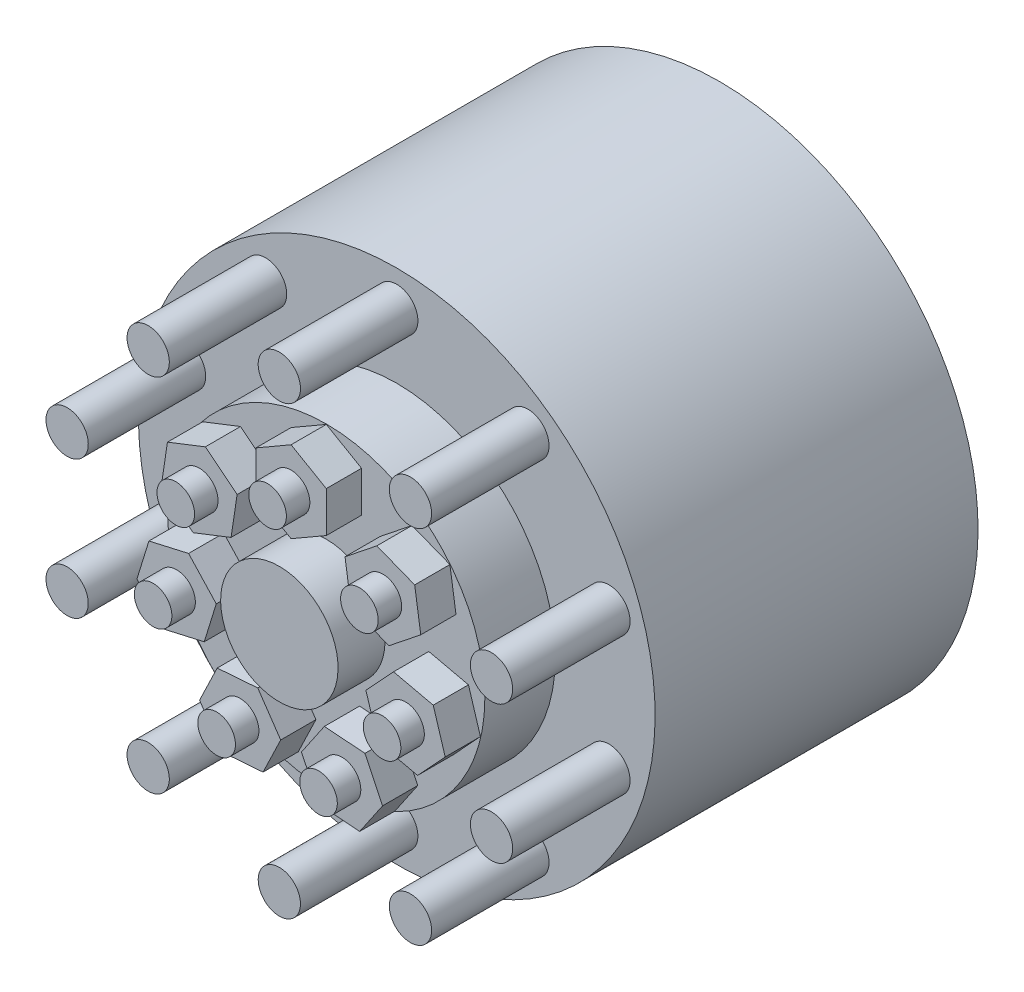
ISO-10303-21;
HEADER;
FILE_DESCRIPTION(('STEP AP214'),'2;1');
FILE_NAME('part.step','',(''),(''),'','','');
FILE_SCHEMA(('AUTOMOTIVE_DESIGN { 1 0 10303 214 1 1 1 1 }'));
ENDSEC;
DATA;
#1=APPLICATION_CONTEXT('core data for automotive mechanical design processes');
#2=APPLICATION_PROTOCOL_DEFINITION('international standard','automotive_design',2000,#1);
#3=PRODUCT_CONTEXT('',#1,'mechanical');
#4=PRODUCT('Part','Part','',(#3));
#5=PRODUCT_RELATED_PRODUCT_CATEGORY('part','',(#4));
#6=PRODUCT_DEFINITION_FORMATION('','',#4);
#7=PRODUCT_DEFINITION_CONTEXT('part definition',#1,'design');
#8=PRODUCT_DEFINITION('design','',#6,#7);
#9=PRODUCT_DEFINITION_SHAPE('','',#8);
#10=(LENGTH_UNIT() NAMED_UNIT(*) SI_UNIT(.MILLI.,.METRE.));
#11=(NAMED_UNIT(*) PLANE_ANGLE_UNIT() SI_UNIT($,.RADIAN.));
#12=(NAMED_UNIT(*) SI_UNIT($,.STERADIAN.) SOLID_ANGLE_UNIT());
#13=UNCERTAINTY_MEASURE_WITH_UNIT(LENGTH_MEASURE(1.E-05),#10,'distance_accuracy_value','');
#14=(GEOMETRIC_REPRESENTATION_CONTEXT(3) GLOBAL_UNCERTAINTY_ASSIGNED_CONTEXT((#13)) GLOBAL_UNIT_ASSIGNED_CONTEXT((#10,
#11,#12)) REPRESENTATION_CONTEXT('',''));
#15=CARTESIAN_POINT('',(0.,0.,0.));
#16=DIRECTION('',(0.,0.,1.));
#17=DIRECTION('',(1.,0.,0.));
#18=AXIS2_PLACEMENT_3D('',#15,#16,#17);
#19=CARTESIAN_POINT('',(0.,50.,335.));
#20=DIRECTION('',(0.,0.,1.));
#21=DIRECTION('',(0.,-1.,0.));
#22=AXIS2_PLACEMENT_3D('',#19,#20,#21);
#23=PLANE('',#22);
#24=DIRECTION('',(-0.294755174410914,-0.955572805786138,0.));
#25=VECTOR('',#24,1.);
#26=CARTESIAN_POINT('',(-121.054666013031,3.14156833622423,335.));
#27=LINE('',#26,#25);
#28=CARTESIAN_POINT('',(-121.054666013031,3.14156833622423,335.));
#29=VERTEX_POINT('',#28);
#30=CARTESIAN_POINT('',(-131.265284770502,-29.9604446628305,335.));
#31=VERTEX_POINT('',#30);
#32=EDGE_CURVE('E378',#29,#31,#27,.T.);
#33=ORIENTED_EDGE('',*,*,#32,.F.);
#34=DIRECTION('',(-0.974927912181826,-0.222520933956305,0.));
#35=VECTOR('',#34,1.);
#36=CARTESIAN_POINT('',(-87.282172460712,10.8499196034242,335.));
#37=LINE('',#36,#35);
#38=CARTESIAN_POINT('',(-87.282172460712,10.8499196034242,335.));
#39=VERTEX_POINT('',#38);
#40=EDGE_CURVE('E349',#39,#29,#37,.T.);
#41=ORIENTED_EDGE('',*,*,#40,.F.);
#42=DIRECTION('',(-0.680172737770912,0.733051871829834,0.));
#43=VECTOR('',#42,1.);
#44=CARTESIAN_POINT('',(-63.7202976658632,-14.5437421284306,335.));
#45=LINE('',#44,#43);
#46=CARTESIAN_POINT('',(-63.7202976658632,-14.5437421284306,335.));
#47=VERTEX_POINT('',#46);
#48=EDGE_CURVE('E359',#47,#39,#45,.T.);
#49=ORIENTED_EDGE('',*,*,#48,.F.);
#50=DIRECTION('',(0.294755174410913,0.955572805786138,0.));
#51=VECTOR('',#50,1.);
#52=CARTESIAN_POINT('',(-73.9309164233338,-47.6457551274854,335.));
#53=LINE('',#52,#51);
#54=CARTESIAN_POINT('',(-73.9309164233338,-47.6457551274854,335.));
#55=VERTEX_POINT('',#54);
#56=EDGE_CURVE('E387',#55,#47,#53,.T.);
#57=ORIENTED_EDGE('',*,*,#56,.F.);
#58=DIRECTION('',(0.974927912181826,0.222520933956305,0.));
#59=VECTOR('',#58,1.);
#60=CARTESIAN_POINT('',(-107.703409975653,-55.3541063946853,335.));
#61=LINE('',#60,#59);
#62=CARTESIAN_POINT('',(-107.703409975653,-55.3541063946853,335.));
#63=VERTEX_POINT('',#62);
#64=EDGE_CURVE('E384',#63,#55,#61,.T.);
#65=ORIENTED_EDGE('',*,*,#64,.F.);
#66=DIRECTION('',(0.680172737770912,-0.733051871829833,0.));
#67=VECTOR('',#66,1.);
#68=CARTESIAN_POINT('',(-131.265284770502,-29.9604446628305,335.));
#69=LINE('',#68,#67);
#70=EDGE_CURVE('E381',#31,#63,#69,.T.);
#71=ORIENTED_EDGE('',*,*,#70,.F.);
#72=EDGE_LOOP('',(#33,#41,#49,#57,#65,#71));
#73=FACE_BOUND('',#72,.T.);
#74=DIRECTION('',(0.99720379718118,-0.0747300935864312,0.));
#75=VECTOR('',#74,1.);
#76=CARTESIAN_POINT('',(23.8743946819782,-118.718637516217,335.));
#77=LINE('',#76,#75);
#78=CARTESIAN_POINT('',(23.8743946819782,-118.718637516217,335.));
#79=VERTEX_POINT('',#78);
#80=CARTESIAN_POINT('',(58.4185475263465,-121.307363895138,335.));
#81=VERTEX_POINT('',#80);
#82=EDGE_CURVE('E500',#79,#81,#77,.T.);
#83=ORIENTED_EDGE('',*,*,#82,.F.);
#84=DIRECTION('',(0.433883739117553,-0.900968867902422,0.));
#85=VECTOR('',#84,1.);
#86=CARTESIAN_POINT('',(8.844221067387,-87.5081604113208,335.));
#87=LINE('',#86,#85);
#88=CARTESIAN_POINT('',(8.844221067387,-87.5081604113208,335.));
#89=VERTEX_POINT('',#88);
#90=EDGE_CURVE('E496',#89,#79,#87,.T.);
#91=ORIENTED_EDGE('',*,*,#90,.F.);
#92=DIRECTION('',(-0.563320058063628,-0.826238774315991,0.));
#93=VECTOR('',#92,1.);
#94=CARTESIAN_POINT('',(28.3582002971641,-58.8864096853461,335.));
#95=LINE('',#94,#93);
#96=CARTESIAN_POINT('',(28.3582002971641,-58.8864096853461,335.));
#97=VERTEX_POINT('',#96);
#98=EDGE_CURVE('E480',#97,#89,#95,.T.);
#99=ORIENTED_EDGE('',*,*,#98,.F.);
#100=DIRECTION('',(-0.99720379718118,0.07473009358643,0.));
#101=VECTOR('',#100,1.);
#102=CARTESIAN_POINT('',(62.9023531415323,-61.4751360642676,335.));
#103=LINE('',#102,#101);
#104=CARTESIAN_POINT('',(62.9023531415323,-61.4751360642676,335.));
#105=VERTEX_POINT('',#104);
#106=EDGE_CURVE('E509',#105,#97,#103,.T.);
#107=ORIENTED_EDGE('',*,*,#106,.F.);
#108=DIRECTION('',(-0.433883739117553,0.900968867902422,0.));
#109=VECTOR('',#108,1.);
#110=CARTESIAN_POINT('',(77.9325267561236,-92.6856131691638,335.));
#111=LINE('',#110,#109);
#112=CARTESIAN_POINT('',(77.9325267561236,-92.6856131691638,335.));
#113=VERTEX_POINT('',#112);
#114=EDGE_CURVE('E506',#113,#105,#111,.T.);
#115=ORIENTED_EDGE('',*,*,#114,.F.);
#116=DIRECTION('',(0.563320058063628,0.826238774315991,0.));
#117=VECTOR('',#116,1.);
#118=CARTESIAN_POINT('',(58.4185475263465,-121.307363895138,335.));
#119=LINE('',#118,#117);
#120=EDGE_CURVE('E503',#81,#113,#119,.T.);
#121=ORIENTED_EDGE('',*,*,#120,.F.);
#122=EDGE_LOOP('',(#83,#91,#99,#107,#115,#121));
#123=FACE_BOUND('',#122,.T.);
#124=DIRECTION('',(-0.149042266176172,0.988830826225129,0.));
#125=VECTOR('',#124,1.);
#126=CARTESIAN_POINT('',(110.42956080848,49.693195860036,335.));
#127=LINE('',#126,#125);
#128=CARTESIAN_POINT('',(110.42956080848,49.693195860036,335.));
#129=VERTEX_POINT('',#128);
#130=CARTESIAN_POINT('',(105.266585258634,83.9473004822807,335.));
#131=VERTEX_POINT('',#130);
#132=EDGE_CURVE('E624',#129,#131,#127,.T.);
#133=ORIENTED_EDGE('',*,*,#132,.F.);
#134=DIRECTION('',(0.781831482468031,0.623489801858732,0.));
#135=VECTOR('',#134,1.);
#136=CARTESIAN_POINT('',(83.3461237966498,28.0948755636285,335.));
#137=LINE('',#136,#135);
#138=CARTESIAN_POINT('',(83.3461237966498,28.0948755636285,335.));
#139=VERTEX_POINT('',#138);
#140=EDGE_CURVE('E620',#139,#129,#137,.T.);
#141=ORIENTED_EDGE('',*,*,#140,.F.);
#142=DIRECTION('',(0.930873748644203,-0.365341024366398,0.));
#143=VECTOR('',#142,1.);
#144=CARTESIAN_POINT('',(51.0997112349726,40.7506598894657,335.));
#145=LINE('',#144,#143);
#146=CARTESIAN_POINT('',(51.0997112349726,40.7506598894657,335.));
#147=VERTEX_POINT('',#146);
#148=EDGE_CURVE('E604',#147,#139,#145,.T.);
#149=ORIENTED_EDGE('',*,*,#148,.F.);
#150=DIRECTION('',(0.149042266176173,-0.988830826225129,0.));
#151=VECTOR('',#150,1.);
#152=CARTESIAN_POINT('',(45.9367356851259,75.0047645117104,335.));
#153=LINE('',#152,#151);
#154=CARTESIAN_POINT('',(45.9367356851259,75.0047645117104,335.));
#155=VERTEX_POINT('',#154);
#156=EDGE_CURVE('E633',#155,#147,#153,.T.);
#157=ORIENTED_EDGE('',*,*,#156,.F.);
#158=DIRECTION('',(-0.781831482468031,-0.623489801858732,0.));
#159=VECTOR('',#158,1.);
#160=CARTESIAN_POINT('',(73.0201726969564,96.6030848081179,335.));
#161=LINE('',#160,#159);
#162=CARTESIAN_POINT('',(73.0201726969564,96.6030848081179,335.));
#163=VERTEX_POINT('',#162);
#164=EDGE_CURVE('E630',#163,#155,#161,.T.);
#165=ORIENTED_EDGE('',*,*,#164,.F.);
#166=DIRECTION('',(-0.930873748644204,0.365341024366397,0.));
#167=VECTOR('',#166,1.);
#168=CARTESIAN_POINT('',(105.266585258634,83.9473004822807,335.));
#169=LINE('',#168,#167);
#170=EDGE_CURVE('E627',#131,#163,#169,.T.);
#171=ORIENTED_EDGE('',*,*,#170,.F.);
#172=EDGE_LOOP('',(#133,#141,#149,#157,#165,#171));
#173=FACE_BOUND('',#172,.T.);
#174=CARTESIAN_POINT('',(0.,0.,335.));
#175=DIRECTION('',(0.,0.,-1.));
#176=DIRECTION('',(0.,1.,0.));
#177=AXIS2_PLACEMENT_3D('',#174,#175,#176);
#178=CIRCLE('',#177,135.);
#179=CARTESIAN_POINT('',(0.,135.,335.));
#180=VERTEX_POINT('',#179);
#181=EDGE_CURVE('E851',#180,#180,#178,.T.);
#182=ORIENTED_EDGE('',*,*,#181,.F.);
#183=EDGE_LOOP('',(#182));
#184=FACE_BOUND('',#183,.T.);
#185=CARTESIAN_POINT('',(0.,0.,335.));
#186=DIRECTION('',(0.,0.,-1.));
#187=DIRECTION('',(0.,1.,0.));
#188=AXIS2_PLACEMENT_3D('',#185,#186,#187);
#189=CIRCLE('',#188,50.);
#190=CARTESIAN_POINT('',(0.,50.,335.));
#191=VERTEX_POINT('',#190);
#192=EDGE_CURVE('E54',#191,#191,#189,.T.);
#193=ORIENTED_EDGE('',*,*,#192,.T.);
#194=EDGE_LOOP('',(#193));
#195=FACE_BOUND('',#194,.T.);
#196=DIRECTION('',(-0.866025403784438,0.500000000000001,0.));
#197=VECTOR('',#196,1.);
#198=CARTESIAN_POINT('',(30.,117.320508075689,335.));
#199=LINE('',#198,#197);
#200=CARTESIAN_POINT('',(30.,117.320508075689,335.));
#201=VERTEX_POINT('',#200);
#202=CARTESIAN_POINT('',(0.,134.641016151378,335.));
#203=VERTEX_POINT('',#202);
#204=EDGE_CURVE('E710',#201,#203,#199,.T.);
#205=ORIENTED_EDGE('',*,*,#204,.F.);
#206=DIRECTION('',(0.,1.,0.));
#207=VECTOR('',#206,1.);
#208=CARTESIAN_POINT('',(30.,82.6794919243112,335.));
#209=LINE('',#208,#207);
#210=CARTESIAN_POINT('',(30.,82.6794919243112,335.));
#211=VERTEX_POINT('',#210);
#212=EDGE_CURVE('E685',#211,#201,#209,.T.);
#213=ORIENTED_EDGE('',*,*,#212,.F.);
#214=DIRECTION('',(0.866025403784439,0.499999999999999,0.));
#215=VECTOR('',#214,1.);
#216=CARTESIAN_POINT('',(0.,65.3589838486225,335.));
#217=LINE('',#216,#215);
#218=CARTESIAN_POINT('',(0.,65.3589838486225,335.));
#219=VERTEX_POINT('',#218);
#220=EDGE_CURVE('E691',#219,#211,#217,.T.);
#221=ORIENTED_EDGE('',*,*,#220,.F.);
#222=DIRECTION('',(0.866025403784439,-0.5,0.));
#223=VECTOR('',#222,1.);
#224=CARTESIAN_POINT('',(-30.,82.6794919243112,335.));
#225=LINE('',#224,#223);
#226=CARTESIAN_POINT('',(-30.,82.6794919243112,335.));
#227=VERTEX_POINT('',#226);
#228=EDGE_CURVE('E719',#227,#219,#225,.T.);
#229=ORIENTED_EDGE('',*,*,#228,.F.);
#230=DIRECTION('',(0.,-1.,0.));
#231=VECTOR('',#230,1.);
#232=CARTESIAN_POINT('',(-30.,117.320508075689,335.));
#233=LINE('',#232,#231);
#234=CARTESIAN_POINT('',(-30.,117.320508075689,335.));
#235=VERTEX_POINT('',#234);
#236=EDGE_CURVE('E716',#235,#227,#233,.T.);
#237=ORIENTED_EDGE('',*,*,#236,.F.);
#238=DIRECTION('',(-0.866025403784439,-0.5,0.));
#239=VECTOR('',#238,1.);
#240=CARTESIAN_POINT('',(0.,134.641016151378,335.));
#241=LINE('',#240,#239);
#242=EDGE_CURVE('E713',#203,#235,#241,.T.);
#243=ORIENTED_EDGE('',*,*,#242,.F.);
#244=EDGE_LOOP('',(#205,#213,#221,#229,#237,#243));
#245=FACE_BOUND('',#244,.T.);
#246=DIRECTION('',(0.680172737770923,0.733051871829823,0.));
#247=VECTOR('',#246,1.);
#248=CARTESIAN_POINT('',(107.703409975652,-55.3541063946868,335.));
#249=LINE('',#248,#247);
#250=CARTESIAN_POINT('',(107.703409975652,-55.3541063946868,335.));
#251=VERTEX_POINT('',#250);
#252=CARTESIAN_POINT('',(131.265284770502,-29.9604446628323,335.));
#253=VERTEX_POINT('',#252);
#254=EDGE_CURVE('E562',#251,#253,#249,.T.);
#255=ORIENTED_EDGE('',*,*,#254,.F.);
#256=DIRECTION('',(0.974927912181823,-0.222520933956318,0.));
#257=VECTOR('',#256,1.);
#258=CARTESIAN_POINT('',(73.9309164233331,-47.6457551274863,335.));
#259=LINE('',#258,#257);
#260=CARTESIAN_POINT('',(73.9309164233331,-47.6457551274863,335.));
#261=VERTEX_POINT('',#260);
#262=EDGE_CURVE('E558',#261,#251,#259,.T.);
#263=ORIENTED_EDGE('',*,*,#262,.F.);
#264=DIRECTION('',(0.294755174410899,-0.955572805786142,0.));
#265=VECTOR('',#264,1.);
#266=CARTESIAN_POINT('',(63.720297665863,-14.5437421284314,335.));
#267=LINE('',#266,#265);
#268=CARTESIAN_POINT('',(63.720297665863,-14.5437421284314,335.));
#269=VERTEX_POINT('',#268);
#270=EDGE_CURVE('E542',#269,#261,#267,.T.);
#271=ORIENTED_EDGE('',*,*,#270,.F.);
#272=DIRECTION('',(-0.680172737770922,-0.733051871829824,0.));
#273=VECTOR('',#272,1.);
#274=CARTESIAN_POINT('',(87.2821724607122,10.8499196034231,335.));
#275=LINE('',#274,#273);
#276=CARTESIAN_POINT('',(87.2821724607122,10.8499196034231,335.));
#277=VERTEX_POINT('',#276);
#278=EDGE_CURVE('E571',#277,#269,#275,.T.);
#279=ORIENTED_EDGE('',*,*,#278,.F.);
#280=DIRECTION('',(-0.974927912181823,0.222520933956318,0.));
#281=VECTOR('',#280,1.);
#282=CARTESIAN_POINT('',(121.054666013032,3.14156833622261,335.));
#283=LINE('',#282,#281);
#284=CARTESIAN_POINT('',(121.054666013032,3.14156833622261,335.));
#285=VERTEX_POINT('',#284);
#286=EDGE_CURVE('E568',#285,#277,#283,.T.);
#287=ORIENTED_EDGE('',*,*,#286,.F.);
#288=DIRECTION('',(-0.2947551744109,0.955572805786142,0.));
#289=VECTOR('',#288,1.);
#290=CARTESIAN_POINT('',(131.265284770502,-29.9604446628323,335.));
#291=LINE('',#290,#289);
#292=EDGE_CURVE('E565',#253,#285,#291,.T.);
#293=ORIENTED_EDGE('',*,*,#292,.F.);
#294=EDGE_LOOP('',(#255,#263,#271,#279,#287,#293));
#295=FACE_BOUND('',#294,.T.);
#296=DIRECTION('',(0.563320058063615,-0.826238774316,0.));
#297=VECTOR('',#296,1.);
#298=CARTESIAN_POINT('',(-77.9325267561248,-92.6856131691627,335.));
#299=LINE('',#298,#297);
#300=CARTESIAN_POINT('',(-77.9325267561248,-92.6856131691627,335.));
#301=VERTEX_POINT('',#300);
#302=CARTESIAN_POINT('',(-58.4185475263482,-121.307363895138,335.));
#303=VERTEX_POINT('',#302);
#304=EDGE_CURVE('E438',#301,#303,#299,.T.);
#305=ORIENTED_EDGE('',*,*,#304,.F.);
#306=DIRECTION('',(-0.433883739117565,-0.900968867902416,0.));
#307=VECTOR('',#306,1.);
#308=CARTESIAN_POINT('',(-62.9023531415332,-61.4751360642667,335.));
#309=LINE('',#308,#307);
#310=CARTESIAN_POINT('',(-62.9023531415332,-61.4751360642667,335.));
#311=VERTEX_POINT('',#310);
#312=EDGE_CURVE('E434',#311,#301,#309,.T.);
#313=ORIENTED_EDGE('',*,*,#312,.F.);
#314=DIRECTION('',(-0.997203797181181,-0.0747300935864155,0.));
#315=VECTOR('',#314,1.);
#316=CARTESIAN_POINT('',(-28.3582002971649,-58.8864096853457,335.));
#317=LINE('',#316,#315);
#318=CARTESIAN_POINT('',(-28.3582002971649,-58.8864096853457,335.));
#319=VERTEX_POINT('',#318);
#320=EDGE_CURVE('E418',#319,#311,#317,.T.);
#321=ORIENTED_EDGE('',*,*,#320,.F.);
#322=DIRECTION('',(-0.563320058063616,0.826238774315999,0.));
#323=VECTOR('',#322,1.);
#324=CARTESIAN_POINT('',(-8.84422106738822,-87.5081604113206,335.));
#325=LINE('',#324,#323);
#326=CARTESIAN_POINT('',(-8.84422106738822,-87.5081604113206,335.));
#327=VERTEX_POINT('',#326);
#328=EDGE_CURVE('E447',#327,#319,#325,.T.);
#329=ORIENTED_EDGE('',*,*,#328,.F.);
#330=DIRECTION('',(0.433883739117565,0.900968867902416,0.));
#331=VECTOR('',#330,1.);
#332=CARTESIAN_POINT('',(-23.8743946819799,-118.718637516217,335.));
#333=LINE('',#332,#331);
#334=CARTESIAN_POINT('',(-23.8743946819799,-118.718637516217,335.));
#335=VERTEX_POINT('',#334);
#336=EDGE_CURVE('E444',#335,#327,#333,.T.);
#337=ORIENTED_EDGE('',*,*,#336,.F.);
#338=DIRECTION('',(0.997203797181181,0.074730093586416,0.));
#339=VECTOR('',#338,1.);
#340=CARTESIAN_POINT('',(-58.4185475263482,-121.307363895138,335.));
#341=LINE('',#340,#339);
#342=EDGE_CURVE('E441',#303,#335,#341,.T.);
#343=ORIENTED_EDGE('',*,*,#342,.F.);
#344=EDGE_LOOP('',(#305,#313,#321,#329,#337,#343));
#345=FACE_BOUND('',#344,.T.);
#346=DIRECTION('',(-0.930873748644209,-0.365341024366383,0.));
#347=VECTOR('',#346,1.);
#348=CARTESIAN_POINT('',(-73.0201726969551,96.6030848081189,335.));
#349=LINE('',#348,#347);
#350=CARTESIAN_POINT('',(-73.0201726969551,96.6030848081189,335.));
#351=VERTEX_POINT('',#350);
#352=CARTESIAN_POINT('',(-105.266585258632,83.9473004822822,335.));
#353=VERTEX_POINT('',#352);
#354=EDGE_CURVE('E939',#351,#353,#349,.T.);
#355=ORIENTED_EDGE('',*,*,#354,.F.);
#356=DIRECTION('',(-0.781831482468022,0.623489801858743,0.));
#357=VECTOR('',#356,1.);
#358=CARTESIAN_POINT('',(-45.9367356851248,75.004764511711,335.));
#359=LINE('',#358,#357);
#360=CARTESIAN_POINT('',(-45.9367356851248,75.004764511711,335.));
#361=VERTEX_POINT('',#360);
#362=EDGE_CURVE('E342',#361,#351,#359,.T.);
#363=ORIENTED_EDGE('',*,*,#362,.F.);
#364=DIRECTION('',(0.149042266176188,0.988830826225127,0.));
#365=VECTOR('',#364,1.);
#366=CARTESIAN_POINT('',(-51.0997112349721,40.7506598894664,335.));
#367=LINE('',#366,#365);
#368=CARTESIAN_POINT('',(-51.0997112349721,40.7506598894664,335.));
#369=VERTEX_POINT('',#368);
#370=EDGE_CURVE('E338',#369,#361,#367,.T.);
#371=ORIENTED_EDGE('',*,*,#370,.F.);
#372=DIRECTION('',(0.930873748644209,0.365341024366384,0.));
#373=VECTOR('',#372,1.);
#374=CARTESIAN_POINT('',(-83.3461237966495,28.0948755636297,335.));
#375=LINE('',#374,#373);
#376=CARTESIAN_POINT('',(-83.3461237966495,28.0948755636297,335.));
#377=VERTEX_POINT('',#376);
#378=EDGE_CURVE('E954',#377,#369,#375,.T.);
#379=ORIENTED_EDGE('',*,*,#378,.F.);
#380=DIRECTION('',(0.781831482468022,-0.623489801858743,0.));
#381=VECTOR('',#380,1.);
#382=CARTESIAN_POINT('',(-110.42956080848,49.6931958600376,335.));
#383=LINE('',#382,#381);
#384=CARTESIAN_POINT('',(-110.42956080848,49.6931958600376,335.));
#385=VERTEX_POINT('',#384);
#386=EDGE_CURVE('E947',#385,#377,#383,.T.);
#387=ORIENTED_EDGE('',*,*,#386,.F.);
#388=DIRECTION('',(-0.149042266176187,-0.988830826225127,0.));
#389=VECTOR('',#388,1.);
#390=CARTESIAN_POINT('',(-105.266585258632,83.9473004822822,335.));
#391=LINE('',#390,#389);
#392=EDGE_CURVE('E942',#353,#385,#391,.T.);
#393=ORIENTED_EDGE('',*,*,#392,.F.);
#394=EDGE_LOOP('',(#355,#363,#371,#379,#387,#393));
#395=FACE_BOUND('',#394,.T.);
#396=ADVANCED_FACE('F44',(#73,#123,#173,#184,#195,#245,#295,#345,#395),#23,.T.);
#397=CARTESIAN_POINT('',(0.,0.,375.));
#398=DIRECTION('',(0.,0.,1.));
#399=DIRECTION('',(0.,-1.,0.));
#400=AXIS2_PLACEMENT_3D('',#397,#398,#399);
#401=PLANE('',#400);
#402=CARTESIAN_POINT('',(0.,0.,375.));
#403=DIRECTION('',(0.,0.,-1.));
#404=DIRECTION('',(0.,1.,0.));
#405=AXIS2_PLACEMENT_3D('',#402,#403,#404);
#406=CIRCLE('',#405,50.);
#407=CARTESIAN_POINT('',(0.,50.,375.));
#408=VERTEX_POINT('',#407);
#409=EDGE_CURVE('E11',#408,#408,#406,.T.);
#410=ORIENTED_EDGE('',*,*,#409,.F.);
#411=EDGE_LOOP('',(#410));
#412=FACE_BOUND('',#411,.T.);
#413=ADVANCED_FACE('F46',(#412),#401,.T.);
#414=CARTESIAN_POINT('',(0.,0.,0.));
#415=DIRECTION('',(0.,0.,-1.));
#416=DIRECTION('',(0.,1.,0.));
#417=AXIS2_PLACEMENT_3D('',#414,#415,#416);
#418=CYLINDRICAL_SURFACE('',#417,50.);
#419=ORIENTED_EDGE('',*,*,#409,.T.);
#420=EDGE_LOOP('',(#419));
#421=FACE_BOUND('',#420,.T.);
#422=ORIENTED_EDGE('',*,*,#192,.F.);
#423=EDGE_LOOP('',(#422));
#424=FACE_BOUND('',#423,.T.);
#425=ADVANCED_FACE('F1308',(#421,#424),#418,.T.);
#426=CARTESIAN_POINT('',(0.,0.,0.));
#427=DIRECTION('',(0.,0.,-1.));
#428=DIRECTION('',(0.,1.,0.));
#429=AXIS2_PLACEMENT_3D('',#426,#427,#428);
#430=CYLINDRICAL_SURFACE('',#429,135.);
#431=ORIENTED_EDGE('',*,*,#181,.T.);
#432=EDGE_LOOP('',(#431));
#433=FACE_BOUND('',#432,.T.);
#434=CARTESIAN_POINT('',(0.,0.,275.));
#435=DIRECTION('',(0.,0.,-1.));
#436=DIRECTION('',(0.,1.,0.));
#437=AXIS2_PLACEMENT_3D('',#434,#435,#436);
#438=CIRCLE('',#437,135.);
#439=CARTESIAN_POINT('',(0.,135.,275.));
#440=VERTEX_POINT('',#439);
#441=EDGE_CURVE('E847',#440,#440,#438,.T.);
#442=ORIENTED_EDGE('',*,*,#441,.F.);
#443=EDGE_LOOP('',(#442));
#444=FACE_BOUND('',#443,.T.);
#445=ADVANCED_FACE('F1305',(#433,#444),#430,.T.);
#446=CARTESIAN_POINT('',(0.,135.,275.));
#447=DIRECTION('',(0.,0.,1.));
#448=DIRECTION('',(0.,-1.,0.));
#449=AXIS2_PLACEMENT_3D('',#446,#447,#448);
#450=PLANE('',#449);
#451=CARTESIAN_POINT('',(-111.679197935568,153.713228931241,275.));
#452=DIRECTION('',(0.,0.,1.));
#453=DIRECTION('',(0.809016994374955,0.587785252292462,0.));
#454=AXIS2_PLACEMENT_3D('',#451,#452,#453);
#455=CIRCLE('',#454,18.);
#456=CARTESIAN_POINT('',(-97.1168920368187,164.293363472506,275.));
#457=VERTEX_POINT('',#456);
#458=EDGE_CURVE('E756',#457,#457,#455,.T.);
#459=ORIENTED_EDGE('',*,*,#458,.F.);
#460=EDGE_LOOP('',(#459));
#461=FACE_BOUND('',#460,.T.);
#462=CARTESIAN_POINT('',(-180.700738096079,58.713228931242,275.));
#463=DIRECTION('',(0.,0.,1.));
#464=DIRECTION('',(0.309016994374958,0.95105651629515,0.));
#465=AXIS2_PLACEMENT_3D('',#462,#463,#464);
#466=CIRCLE('',#465,18.);
#467=CARTESIAN_POINT('',(-175.138432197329,75.8322462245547,275.));
#468=VERTEX_POINT('',#467);
#469=EDGE_CURVE('E764',#468,#468,#466,.T.);
#470=ORIENTED_EDGE('',*,*,#469,.F.);
#471=EDGE_LOOP('',(#470));
#472=FACE_BOUND('',#471,.T.);
#473=CARTESIAN_POINT('',(-180.70073809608,-58.7132289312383,275.));
#474=DIRECTION('',(0.,0.,1.));
#475=DIRECTION('',(-0.309016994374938,0.951056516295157,0.));
#476=AXIS2_PLACEMENT_3D('',#473,#474,#475);
#477=CIRCLE('',#476,18.);
#478=CARTESIAN_POINT('',(-186.263043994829,-41.5942116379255,275.));
#479=VERTEX_POINT('',#478);
#480=EDGE_CURVE('E772',#479,#479,#477,.T.);
#481=ORIENTED_EDGE('',*,*,#480,.F.);
#482=EDGE_LOOP('',(#481));
#483=FACE_BOUND('',#482,.T.);
#484=CARTESIAN_POINT('',(-111.679197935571,-153.713228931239,275.));
#485=DIRECTION('',(0.,0.,1.));
#486=DIRECTION('',(-0.809016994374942,0.58778525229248,0.));
#487=AXIS2_PLACEMENT_3D('',#484,#485,#486);
#488=CIRCLE('',#487,18.);
#489=CARTESIAN_POINT('',(-126.24150383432,-143.133094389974,275.));
#490=VERTEX_POINT('',#489);
#491=EDGE_CURVE('E780',#490,#490,#488,.T.);
#492=ORIENTED_EDGE('',*,*,#491,.F.);
#493=EDGE_LOOP('',(#492));
#494=FACE_BOUND('',#493,.T.);
#495=CARTESIAN_POINT('',(0.,-190.,275.));
#496=DIRECTION('',(0.,0.,1.));
#497=DIRECTION('',(-1.,0.,0.));
#498=AXIS2_PLACEMENT_3D('',#495,#496,#497);
#499=CIRCLE('',#498,18.);
#500=CARTESIAN_POINT('',(-18.,-190.,275.));
#501=VERTEX_POINT('',#500);
#502=EDGE_CURVE('E788',#501,#501,#499,.T.);
#503=ORIENTED_EDGE('',*,*,#502,.F.);
#504=EDGE_LOOP('',(#503));
#505=FACE_BOUND('',#504,.T.);
#506=CARTESIAN_POINT('',(111.679197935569,-153.713228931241,275.));
#507=DIRECTION('',(0.,0.,1.));
#508=DIRECTION('',(-0.809016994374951,-0.587785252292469,0.));
#509=AXIS2_PLACEMENT_3D('',#506,#507,#508);
#510=CIRCLE('',#509,18.);
#511=CARTESIAN_POINT('',(97.1168920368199,-164.293363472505,275.));
#512=VERTEX_POINT('',#511);
#513=EDGE_CURVE('E796',#512,#512,#510,.T.);
#514=ORIENTED_EDGE('',*,*,#513,.F.);
#515=EDGE_LOOP('',(#514));
#516=FACE_BOUND('',#515,.T.);
#517=CARTESIAN_POINT('',(180.700738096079,-58.7132289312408,275.));
#518=DIRECTION('',(0.,0.,1.));
#519=DIRECTION('',(-0.309016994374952,-0.951056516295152,0.));
#520=AXIS2_PLACEMENT_3D('',#517,#518,#519);
#521=CIRCLE('',#520,18.);
#522=CARTESIAN_POINT('',(175.13843219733,-75.8322462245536,275.));
#523=VERTEX_POINT('',#522);
#524=EDGE_CURVE('E804',#523,#523,#521,.T.);
#525=ORIENTED_EDGE('',*,*,#524,.F.);
#526=EDGE_LOOP('',(#525));
#527=FACE_BOUND('',#526,.T.);
#528=CARTESIAN_POINT('',(180.700738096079,58.7132289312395,275.));
#529=DIRECTION('',(0.,0.,1.));
#530=DIRECTION('',(0.309016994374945,-0.951056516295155,0.));
#531=AXIS2_PLACEMENT_3D('',#528,#529,#530);
#532=CIRCLE('',#531,18.);
#533=CARTESIAN_POINT('',(186.263043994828,41.5942116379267,275.));
#534=VERTEX_POINT('',#533);
#535=EDGE_CURVE('E812',#534,#534,#532,.T.);
#536=ORIENTED_EDGE('',*,*,#535,.F.);
#537=EDGE_LOOP('',(#536));
#538=FACE_BOUND('',#537,.T.);
#539=CARTESIAN_POINT('',(111.67919793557,153.71322893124,275.));
#540=DIRECTION('',(0.,0.,1.));
#541=DIRECTION('',(0.809016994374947,-0.587785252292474,0.));
#542=AXIS2_PLACEMENT_3D('',#539,#540,#541);
#543=CIRCLE('',#542,18.);
#544=CARTESIAN_POINT('',(126.241503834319,143.133094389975,275.));
#545=VERTEX_POINT('',#544);
#546=EDGE_CURVE('E820',#545,#545,#543,.T.);
#547=ORIENTED_EDGE('',*,*,#546,.F.);
#548=EDGE_LOOP('',(#547));
#549=FACE_BOUND('',#548,.T.);
#550=CARTESIAN_POINT('',(0.,190.,275.));
#551=DIRECTION('',(0.,0.,1.));
#552=DIRECTION('',(1.,0.,0.));
#553=AXIS2_PLACEMENT_3D('',#550,#551,#552);
#554=CIRCLE('',#553,18.);
#555=CARTESIAN_POINT('',(18.,190.,275.));
#556=VERTEX_POINT('',#555);
#557=EDGE_CURVE('E828',#556,#556,#554,.T.);
#558=ORIENTED_EDGE('',*,*,#557,.F.);
#559=EDGE_LOOP('',(#558));
#560=FACE_BOUND('',#559,.T.);
#561=ORIENTED_EDGE('',*,*,#441,.T.);
#562=EDGE_LOOP('',(#561));
#563=FACE_BOUND('',#562,.T.);
#564=CARTESIAN_POINT('',(0.,0.,275.));
#565=DIRECTION('',(0.,0.,-1.));
#566=DIRECTION('',(0.,1.,0.));
#567=AXIS2_PLACEMENT_3D('',#564,#565,#566);
#568=CIRCLE('',#567,220.);
#569=CARTESIAN_POINT('',(0.,220.,275.));
#570=VERTEX_POINT('',#569);
#571=EDGE_CURVE('E843',#570,#570,#568,.T.);
#572=ORIENTED_EDGE('',*,*,#571,.F.);
#573=EDGE_LOOP('',(#572));
#574=FACE_BOUND('',#573,.T.);
#575=ADVANCED_FACE('F1301',(#461,#472,#483,#494,#505,#516,#527,#538,#549,#560,#563,#574),#450,.T.);
#576=CARTESIAN_POINT('',(0.,0.,0.));
#577=DIRECTION('',(0.,0.,-1.));
#578=DIRECTION('',(0.,1.,0.));
#579=AXIS2_PLACEMENT_3D('',#576,#577,#578);
#580=CYLINDRICAL_SURFACE('',#579,220.);
#581=ORIENTED_EDGE('',*,*,#571,.T.);
#582=EDGE_LOOP('',(#581));
#583=FACE_BOUND('',#582,.T.);
#584=CARTESIAN_POINT('',(0.,0.,0.));
#585=DIRECTION('',(0.,0.,-1.));
#586=DIRECTION('',(0.,1.,0.));
#587=AXIS2_PLACEMENT_3D('',#584,#585,#586);
#588=CIRCLE('',#587,220.);
#589=CARTESIAN_POINT('',(0.,220.,0.));
#590=VERTEX_POINT('',#589);
#591=EDGE_CURVE('E836',#590,#590,#588,.T.);
#592=ORIENTED_EDGE('',*,*,#591,.F.);
#593=EDGE_LOOP('',(#592));
#594=FACE_BOUND('',#593,.T.);
#595=ADVANCED_FACE('F1297',(#583,#594),#580,.T.);
#596=CARTESIAN_POINT('',(0.,220.,0.));
#597=DIRECTION('',(0.,0.,-1.));
#598=DIRECTION('',(0.,1.,0.));
#599=AXIS2_PLACEMENT_3D('',#596,#597,#598);
#600=PLANE('',#599);
#601=CARTESIAN_POINT('',(0.,0.,0.));
#602=DIRECTION('',(0.,0.,-1.));
#603=DIRECTION('',(0.,1.,0.));
#604=AXIS2_PLACEMENT_3D('',#601,#602,#603);
#605=CIRCLE('',#604,80.);
#606=CARTESIAN_POINT('',(0.,80.,0.));
#607=VERTEX_POINT('',#606);
#608=EDGE_CURVE('E751',#607,#607,#605,.T.);
#609=ORIENTED_EDGE('',*,*,#608,.F.);
#610=EDGE_LOOP('',(#609));
#611=FACE_BOUND('',#610,.T.);
#612=ORIENTED_EDGE('',*,*,#591,.T.);
#613=EDGE_LOOP('',(#612));
#614=FACE_BOUND('',#613,.T.);
#615=ADVANCED_FACE('F1293',(#611,#614),#600,.T.);
#616=CARTESIAN_POINT('',(0.,190.,375.));
#617=DIRECTION('',(0.,0.,-1.));
#618=DIRECTION('',(-1.,0.,0.));
#619=AXIS2_PLACEMENT_3D('',#616,#617,#618);
#620=CYLINDRICAL_SURFACE('',#619,18.);
#621=CARTESIAN_POINT('',(0.,190.,375.));
#622=DIRECTION('',(0.,0.,1.));
#623=DIRECTION('',(1.,0.,0.));
#624=AXIS2_PLACEMENT_3D('',#621,#622,#623);
#625=CIRCLE('',#624,18.);
#626=CARTESIAN_POINT('',(18.,190.,375.));
#627=VERTEX_POINT('',#626);
#628=EDGE_CURVE('E832',#627,#627,#625,.T.);
#629=ORIENTED_EDGE('',*,*,#628,.F.);
#630=EDGE_LOOP('',(#629));
#631=FACE_BOUND('',#630,.T.);
#632=ORIENTED_EDGE('',*,*,#557,.T.);
#633=EDGE_LOOP('',(#632));
#634=FACE_BOUND('',#633,.T.);
#635=ADVANCED_FACE('F1289',(#631,#634),#620,.T.);
#636=CARTESIAN_POINT('',(0.,190.,375.));
#637=DIRECTION('',(0.,0.,1.));
#638=DIRECTION('',(1.,0.,0.));
#639=AXIS2_PLACEMENT_3D('',#636,#637,#638);
#640=PLANE('',#639);
#641=ORIENTED_EDGE('',*,*,#628,.T.);
#642=EDGE_LOOP('',(#641));
#643=FACE_BOUND('',#642,.T.);
#644=ADVANCED_FACE('F1285',(#643),#640,.T.);
#645=CARTESIAN_POINT('',(111.67919793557,153.71322893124,375.));
#646=DIRECTION('',(0.,0.,-1.));
#647=DIRECTION('',(-1.,0.,0.));
#648=AXIS2_PLACEMENT_3D('',#645,#646,#647);
#649=CYLINDRICAL_SURFACE('',#648,18.);
#650=CARTESIAN_POINT('',(111.67919793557,153.71322893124,375.));
#651=DIRECTION('',(0.,0.,1.));
#652=DIRECTION('',(0.809016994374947,-0.587785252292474,0.));
#653=AXIS2_PLACEMENT_3D('',#650,#651,#652);
#654=CIRCLE('',#653,18.);
#655=CARTESIAN_POINT('',(126.241503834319,143.133094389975,375.));
#656=VERTEX_POINT('',#655);
#657=EDGE_CURVE('E824',#656,#656,#654,.T.);
#658=ORIENTED_EDGE('',*,*,#657,.F.);
#659=EDGE_LOOP('',(#658));
#660=FACE_BOUND('',#659,.T.);
#661=ORIENTED_EDGE('',*,*,#546,.T.);
#662=EDGE_LOOP('',(#661));
#663=FACE_BOUND('',#662,.T.);
#664=ADVANCED_FACE('F1281',(#660,#663),#649,.T.);
#665=CARTESIAN_POINT('',(111.67919793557,153.71322893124,375.));
#666=DIRECTION('',(0.,0.,1.));
#667=DIRECTION('',(0.809016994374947,-0.587785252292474,0.));
#668=AXIS2_PLACEMENT_3D('',#665,#666,#667);
#669=PLANE('',#668);
#670=ORIENTED_EDGE('',*,*,#657,.T.);
#671=EDGE_LOOP('',(#670));
#672=FACE_BOUND('',#671,.T.);
#673=ADVANCED_FACE('F1277',(#672),#669,.T.);
#674=CARTESIAN_POINT('',(180.700738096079,58.7132289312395,375.));
#675=DIRECTION('',(0.,0.,-1.));
#676=DIRECTION('',(-1.,0.,0.));
#677=AXIS2_PLACEMENT_3D('',#674,#675,#676);
#678=CYLINDRICAL_SURFACE('',#677,18.);
#679=CARTESIAN_POINT('',(180.700738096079,58.7132289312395,375.));
#680=DIRECTION('',(0.,0.,1.));
#681=DIRECTION('',(0.309016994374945,-0.951056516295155,0.));
#682=AXIS2_PLACEMENT_3D('',#679,#680,#681);
#683=CIRCLE('',#682,18.);
#684=CARTESIAN_POINT('',(186.263043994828,41.5942116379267,375.));
#685=VERTEX_POINT('',#684);
#686=EDGE_CURVE('E816',#685,#685,#683,.T.);
#687=ORIENTED_EDGE('',*,*,#686,.F.);
#688=EDGE_LOOP('',(#687));
#689=FACE_BOUND('',#688,.T.);
#690=ORIENTED_EDGE('',*,*,#535,.T.);
#691=EDGE_LOOP('',(#690));
#692=FACE_BOUND('',#691,.T.);
#693=ADVANCED_FACE('F1273',(#689,#692),#678,.T.);
#694=CARTESIAN_POINT('',(180.700738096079,58.7132289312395,375.));
#695=DIRECTION('',(0.,0.,1.));
#696=DIRECTION('',(0.309016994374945,-0.951056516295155,0.));
#697=AXIS2_PLACEMENT_3D('',#694,#695,#696);
#698=PLANE('',#697);
#699=ORIENTED_EDGE('',*,*,#686,.T.);
#700=EDGE_LOOP('',(#699));
#701=FACE_BOUND('',#700,.T.);
#702=ADVANCED_FACE('F1269',(#701),#698,.T.);
#703=CARTESIAN_POINT('',(180.700738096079,-58.7132289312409,375.));
#704=DIRECTION('',(0.,0.,-1.));
#705=DIRECTION('',(0.,1.,0.));
#706=AXIS2_PLACEMENT_3D('',#703,#704,#705);
#707=CYLINDRICAL_SURFACE('',#706,18.);
#708=CARTESIAN_POINT('',(180.700738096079,-58.7132289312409,375.));
#709=DIRECTION('',(0.,0.,1.));
#710=DIRECTION('',(-0.309016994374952,-0.951056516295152,0.));
#711=AXIS2_PLACEMENT_3D('',#708,#709,#710);
#712=CIRCLE('',#711,18.);
#713=CARTESIAN_POINT('',(175.13843219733,-75.8322462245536,375.));
#714=VERTEX_POINT('',#713);
#715=EDGE_CURVE('E808',#714,#714,#712,.T.);
#716=ORIENTED_EDGE('',*,*,#715,.F.);
#717=EDGE_LOOP('',(#716));
#718=FACE_BOUND('',#717,.T.);
#719=ORIENTED_EDGE('',*,*,#524,.T.);
#720=EDGE_LOOP('',(#719));
#721=FACE_BOUND('',#720,.T.);
#722=ADVANCED_FACE('F1265',(#718,#721),#707,.T.);
#723=CARTESIAN_POINT('',(180.700738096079,-58.7132289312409,375.));
#724=DIRECTION('',(0.,0.,1.));
#725=DIRECTION('',(-0.309016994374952,-0.951056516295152,0.));
#726=AXIS2_PLACEMENT_3D('',#723,#724,#725);
#727=PLANE('',#726);
#728=ORIENTED_EDGE('',*,*,#715,.T.);
#729=EDGE_LOOP('',(#728));
#730=FACE_BOUND('',#729,.T.);
#731=ADVANCED_FACE('F1261',(#730),#727,.T.);
#732=CARTESIAN_POINT('',(111.679197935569,-153.713228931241,375.));
#733=DIRECTION('',(0.,0.,-1.));
#734=DIRECTION('',(0.,1.,0.));
#735=AXIS2_PLACEMENT_3D('',#732,#733,#734);
#736=CYLINDRICAL_SURFACE('',#735,18.);
#737=CARTESIAN_POINT('',(111.679197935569,-153.713228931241,375.));
#738=DIRECTION('',(0.,0.,1.));
#739=DIRECTION('',(-0.809016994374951,-0.587785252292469,0.));
#740=AXIS2_PLACEMENT_3D('',#737,#738,#739);
#741=CIRCLE('',#740,18.);
#742=CARTESIAN_POINT('',(97.1168920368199,-164.293363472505,375.));
#743=VERTEX_POINT('',#742);
#744=EDGE_CURVE('E800',#743,#743,#741,.T.);
#745=ORIENTED_EDGE('',*,*,#744,.F.);
#746=EDGE_LOOP('',(#745));
#747=FACE_BOUND('',#746,.T.);
#748=ORIENTED_EDGE('',*,*,#513,.T.);
#749=EDGE_LOOP('',(#748));
#750=FACE_BOUND('',#749,.T.);
#751=ADVANCED_FACE('F1257',(#747,#750),#736,.T.);
#752=CARTESIAN_POINT('',(111.679197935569,-153.713228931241,375.));
#753=DIRECTION('',(0.,0.,1.));
#754=DIRECTION('',(-0.809016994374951,-0.587785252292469,0.));
#755=AXIS2_PLACEMENT_3D('',#752,#753,#754);
#756=PLANE('',#755);
#757=ORIENTED_EDGE('',*,*,#744,.T.);
#758=EDGE_LOOP('',(#757));
#759=FACE_BOUND('',#758,.T.);
#760=ADVANCED_FACE('F1253',(#759),#756,.T.);
#761=CARTESIAN_POINT('',(0.,-190.,375.));
#762=DIRECTION('',(0.,0.,-1.));
#763=DIRECTION('',(0.,1.,0.));
#764=AXIS2_PLACEMENT_3D('',#761,#762,#763);
#765=CYLINDRICAL_SURFACE('',#764,18.);
#766=CARTESIAN_POINT('',(0.,-190.,375.));
#767=DIRECTION('',(0.,0.,1.));
#768=DIRECTION('',(-1.,0.,0.));
#769=AXIS2_PLACEMENT_3D('',#766,#767,#768);
#770=CIRCLE('',#769,18.);
#771=CARTESIAN_POINT('',(-18.,-190.,375.));
#772=VERTEX_POINT('',#771);
#773=EDGE_CURVE('E792',#772,#772,#770,.T.);
#774=ORIENTED_EDGE('',*,*,#773,.F.);
#775=EDGE_LOOP('',(#774));
#776=FACE_BOUND('',#775,.T.);
#777=ORIENTED_EDGE('',*,*,#502,.T.);
#778=EDGE_LOOP('',(#777));
#779=FACE_BOUND('',#778,.T.);
#780=ADVANCED_FACE('F1249',(#776,#779),#765,.T.);
#781=CARTESIAN_POINT('',(0.,-190.,375.));
#782=DIRECTION('',(0.,0.,1.));
#783=DIRECTION('',(-1.,0.,0.));
#784=AXIS2_PLACEMENT_3D('',#781,#782,#783);
#785=PLANE('',#784);
#786=ORIENTED_EDGE('',*,*,#773,.T.);
#787=EDGE_LOOP('',(#786));
#788=FACE_BOUND('',#787,.T.);
#789=ADVANCED_FACE('F1245',(#788),#785,.T.);
#790=CARTESIAN_POINT('',(-111.679197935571,-153.713228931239,375.));
#791=DIRECTION('',(0.,0.,-1.));
#792=DIRECTION('',(0.,1.,0.));
#793=AXIS2_PLACEMENT_3D('',#790,#791,#792);
#794=CYLINDRICAL_SURFACE('',#793,18.);
#795=CARTESIAN_POINT('',(-111.679197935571,-153.713228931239,375.));
#796=DIRECTION('',(0.,0.,1.));
#797=DIRECTION('',(-0.809016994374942,0.58778525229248,0.));
#798=AXIS2_PLACEMENT_3D('',#795,#796,#797);
#799=CIRCLE('',#798,18.);
#800=CARTESIAN_POINT('',(-126.24150383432,-143.133094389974,375.));
#801=VERTEX_POINT('',#800);
#802=EDGE_CURVE('E784',#801,#801,#799,.T.);
#803=ORIENTED_EDGE('',*,*,#802,.F.);
#804=EDGE_LOOP('',(#803));
#805=FACE_BOUND('',#804,.T.);
#806=ORIENTED_EDGE('',*,*,#491,.T.);
#807=EDGE_LOOP('',(#806));
#808=FACE_BOUND('',#807,.T.);
#809=ADVANCED_FACE('F1241',(#805,#808),#794,.T.);
#810=CARTESIAN_POINT('',(-111.679197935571,-153.713228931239,375.));
#811=DIRECTION('',(0.,0.,1.));
#812=DIRECTION('',(-0.809016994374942,0.58778525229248,0.));
#813=AXIS2_PLACEMENT_3D('',#810,#811,#812);
#814=PLANE('',#813);
#815=ORIENTED_EDGE('',*,*,#802,.T.);
#816=EDGE_LOOP('',(#815));
#817=FACE_BOUND('',#816,.T.);
#818=ADVANCED_FACE('F1237',(#817),#814,.T.);
#819=CARTESIAN_POINT('',(-180.70073809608,-58.7132289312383,375.));
#820=DIRECTION('',(0.,0.,-1.));
#821=DIRECTION('',(0.,1.,0.));
#822=AXIS2_PLACEMENT_3D('',#819,#820,#821);
#823=CYLINDRICAL_SURFACE('',#822,18.);
#824=CARTESIAN_POINT('',(-180.70073809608,-58.7132289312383,375.));
#825=DIRECTION('',(0.,0.,1.));
#826=DIRECTION('',(-0.309016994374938,0.951056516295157,0.));
#827=AXIS2_PLACEMENT_3D('',#824,#825,#826);
#828=CIRCLE('',#827,18.);
#829=CARTESIAN_POINT('',(-186.263043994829,-41.5942116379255,375.));
#830=VERTEX_POINT('',#829);
#831=EDGE_CURVE('E776',#830,#830,#828,.T.);
#832=ORIENTED_EDGE('',*,*,#831,.F.);
#833=EDGE_LOOP('',(#832));
#834=FACE_BOUND('',#833,.T.);
#835=ORIENTED_EDGE('',*,*,#480,.T.);
#836=EDGE_LOOP('',(#835));
#837=FACE_BOUND('',#836,.T.);
#838=ADVANCED_FACE('F1233',(#834,#837),#823,.T.);
#839=CARTESIAN_POINT('',(-180.70073809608,-58.7132289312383,375.));
#840=DIRECTION('',(0.,0.,1.));
#841=DIRECTION('',(-0.309016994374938,0.951056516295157,0.));
#842=AXIS2_PLACEMENT_3D('',#839,#840,#841);
#843=PLANE('',#842);
#844=ORIENTED_EDGE('',*,*,#831,.T.);
#845=EDGE_LOOP('',(#844));
#846=FACE_BOUND('',#845,.T.);
#847=ADVANCED_FACE('F1229',(#846),#843,.T.);
#848=CARTESIAN_POINT('',(-180.700738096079,58.713228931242,375.));
#849=DIRECTION('',(0.,0.,-1.));
#850=DIRECTION('',(-1.,0.,0.));
#851=AXIS2_PLACEMENT_3D('',#848,#849,#850);
#852=CYLINDRICAL_SURFACE('',#851,18.);
#853=CARTESIAN_POINT('',(-180.700738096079,58.713228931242,375.));
#854=DIRECTION('',(0.,0.,1.));
#855=DIRECTION('',(0.309016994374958,0.95105651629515,0.));
#856=AXIS2_PLACEMENT_3D('',#853,#854,#855);
#857=CIRCLE('',#856,18.);
#858=CARTESIAN_POINT('',(-175.138432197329,75.8322462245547,375.));
#859=VERTEX_POINT('',#858);
#860=EDGE_CURVE('E768',#859,#859,#857,.T.);
#861=ORIENTED_EDGE('',*,*,#860,.F.);
#862=EDGE_LOOP('',(#861));
#863=FACE_BOUND('',#862,.T.);
#864=ORIENTED_EDGE('',*,*,#469,.T.);
#865=EDGE_LOOP('',(#864));
#866=FACE_BOUND('',#865,.T.);
#867=ADVANCED_FACE('F1225',(#863,#866),#852,.T.);
#868=CARTESIAN_POINT('',(-180.700738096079,58.713228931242,375.));
#869=DIRECTION('',(0.,0.,1.));
#870=DIRECTION('',(0.309016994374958,0.95105651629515,0.));
#871=AXIS2_PLACEMENT_3D('',#868,#869,#870);
#872=PLANE('',#871);
#873=ORIENTED_EDGE('',*,*,#860,.T.);
#874=EDGE_LOOP('',(#873));
#875=FACE_BOUND('',#874,.T.);
#876=ADVANCED_FACE('F1221',(#875),#872,.T.);
#877=CARTESIAN_POINT('',(-111.679197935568,153.713228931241,375.));
#878=DIRECTION('',(0.,0.,-1.));
#879=DIRECTION('',(-1.,0.,0.));
#880=AXIS2_PLACEMENT_3D('',#877,#878,#879);
#881=CYLINDRICAL_SURFACE('',#880,18.);
#882=CARTESIAN_POINT('',(-111.679197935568,153.713228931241,375.));
#883=DIRECTION('',(0.,0.,1.));
#884=DIRECTION('',(0.809016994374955,0.587785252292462,0.));
#885=AXIS2_PLACEMENT_3D('',#882,#883,#884);
#886=CIRCLE('',#885,18.);
#887=CARTESIAN_POINT('',(-97.1168920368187,164.293363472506,375.));
#888=VERTEX_POINT('',#887);
#889=EDGE_CURVE('E760',#888,#888,#886,.T.);
#890=ORIENTED_EDGE('',*,*,#889,.F.);
#891=EDGE_LOOP('',(#890));
#892=FACE_BOUND('',#891,.T.);
#893=ORIENTED_EDGE('',*,*,#458,.T.);
#894=EDGE_LOOP('',(#893));
#895=FACE_BOUND('',#894,.T.);
#896=ADVANCED_FACE('F1217',(#892,#895),#881,.T.);
#897=CARTESIAN_POINT('',(-111.679197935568,153.713228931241,375.));
#898=DIRECTION('',(0.,0.,1.));
#899=DIRECTION('',(0.809016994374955,0.587785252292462,0.));
#900=AXIS2_PLACEMENT_3D('',#897,#898,#899);
#901=PLANE('',#900);
#902=ORIENTED_EDGE('',*,*,#889,.T.);
#903=EDGE_LOOP('',(#902));
#904=FACE_BOUND('',#903,.T.);
#905=ADVANCED_FACE('F1213',(#904),#901,.T.);
#906=CARTESIAN_POINT('',(0.,0.,50.));
#907=DIRECTION('',(0.,0.,-1.));
#908=DIRECTION('',(0.,1.,0.));
#909=AXIS2_PLACEMENT_3D('',#906,#907,#908);
#910=CYLINDRICAL_SURFACE('',#909,80.);
#911=CARTESIAN_POINT('',(0.,0.,50.));
#912=DIRECTION('',(0.,0.,-1.));
#913=DIRECTION('',(0.,1.,0.));
#914=AXIS2_PLACEMENT_3D('',#911,#912,#913);
#915=CIRCLE('',#914,80.);
#916=CARTESIAN_POINT('',(0.,80.,50.));
#917=VERTEX_POINT('',#916);
#918=EDGE_CURVE('E752',#917,#917,#915,.T.);
#919=ORIENTED_EDGE('',*,*,#918,.F.);
#920=EDGE_LOOP('',(#919));
#921=FACE_BOUND('',#920,.T.);
#922=ORIENTED_EDGE('',*,*,#608,.T.);
#923=EDGE_LOOP('',(#922));
#924=FACE_BOUND('',#923,.T.);
#925=ADVANCED_FACE('F1209',(#921,#924),#910,.F.);
#926=CARTESIAN_POINT('',(0.,0.,50.));
#927=DIRECTION('',(0.,0.,-1.));
#928=DIRECTION('',(0.,1.,0.));
#929=AXIS2_PLACEMENT_3D('',#926,#927,#928);
#930=PLANE('',#929);
#931=ORIENTED_EDGE('',*,*,#918,.T.);
#932=EDGE_LOOP('',(#931));
#933=FACE_BOUND('',#932,.T.);
#934=ADVANCED_FACE('F1199',(#933),#930,.T.);
#935=CARTESIAN_POINT('',(30.,82.6794919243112,365.));
#936=DIRECTION('',(-1.,0.,0.));
#937=DIRECTION('',(0.,-1.,0.));
#938=AXIS2_PLACEMENT_3D('',#935,#936,#937);
#939=PLANE('',#938);
#940=ORIENTED_EDGE('',*,*,#212,.T.);
#941=DIRECTION('',(0.,0.,-1.));
#942=VECTOR('',#941,1.);
#943=CARTESIAN_POINT('',(30.,117.320508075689,365.));
#944=LINE('',#943,#942);
#945=CARTESIAN_POINT('',(30.,117.320508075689,365.));
#946=VERTEX_POINT('',#945);
#947=EDGE_CURVE('E743',#946,#201,#944,.T.);
#948=ORIENTED_EDGE('',*,*,#947,.F.);
#949=DIRECTION('',(0.,1.,0.));
#950=VECTOR('',#949,1.);
#951=CARTESIAN_POINT('',(30.,82.6794919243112,365.));
#952=LINE('',#951,#950);
#953=CARTESIAN_POINT('',(30.,82.6794919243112,365.));
#954=VERTEX_POINT('',#953);
#955=EDGE_CURVE('E686',#954,#946,#952,.T.);
#956=ORIENTED_EDGE('',*,*,#955,.F.);
#957=DIRECTION('',(0.,0.,-1.));
#958=VECTOR('',#957,1.);
#959=CARTESIAN_POINT('',(30.,82.6794919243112,365.));
#960=LINE('',#959,#958);
#961=EDGE_CURVE('E706',#954,#211,#960,.T.);
#962=ORIENTED_EDGE('',*,*,#961,.T.);
#963=EDGE_LOOP('',(#940,#948,#956,#962));
#964=FACE_BOUND('',#963,.T.);
#965=ADVANCED_FACE('F1195',(#964),#939,.F.);
#966=CARTESIAN_POINT('',(30.,117.320508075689,365.));
#967=DIRECTION('',(-0.500000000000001,-0.866025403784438,0.));
#968=DIRECTION('',(0.866025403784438,-0.500000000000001,0.));
#969=AXIS2_PLACEMENT_3D('',#966,#967,#968);
#970=PLANE('',#969);
#971=ORIENTED_EDGE('',*,*,#204,.T.);
#972=DIRECTION('',(0.,0.,-1.));
#973=VECTOR('',#972,1.);
#974=CARTESIAN_POINT('',(0.,134.641016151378,365.));
#975=LINE('',#974,#973);
#976=CARTESIAN_POINT('',(0.,134.641016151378,365.));
#977=VERTEX_POINT('',#976);
#978=EDGE_CURVE('E739',#977,#203,#975,.T.);
#979=ORIENTED_EDGE('',*,*,#978,.F.);
#980=DIRECTION('',(-0.866025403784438,0.500000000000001,0.));
#981=VECTOR('',#980,1.);
#982=CARTESIAN_POINT('',(30.,117.320508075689,365.));
#983=LINE('',#982,#981);
#984=EDGE_CURVE('E690',#946,#977,#983,.T.);
#985=ORIENTED_EDGE('',*,*,#984,.F.);
#986=ORIENTED_EDGE('',*,*,#947,.T.);
#987=EDGE_LOOP('',(#971,#979,#985,#986));
#988=FACE_BOUND('',#987,.T.);
#989=ADVANCED_FACE('F1191',(#988),#970,.F.);
#990=CARTESIAN_POINT('',(0.,134.641016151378,365.));
#991=DIRECTION('',(0.5,-0.866025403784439,0.));
#992=DIRECTION('',(0.866025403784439,0.5,0.));
#993=AXIS2_PLACEMENT_3D('',#990,#991,#992);
#994=PLANE('',#993);
#995=ORIENTED_EDGE('',*,*,#242,.T.);
#996=DIRECTION('',(0.,0.,-1.));
#997=VECTOR('',#996,1.);
#998=CARTESIAN_POINT('',(-30.,117.320508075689,365.));
#999=LINE('',#998,#997);
#1000=CARTESIAN_POINT('',(-30.,117.320508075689,365.));
#1001=VERTEX_POINT('',#1000);
#1002=EDGE_CURVE('E735',#1001,#235,#999,.T.);
#1003=ORIENTED_EDGE('',*,*,#1002,.F.);
#1004=DIRECTION('',(-0.866025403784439,-0.5,0.));
#1005=VECTOR('',#1004,1.);
#1006=CARTESIAN_POINT('',(0.,134.641016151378,365.));
#1007=LINE('',#1006,#1005);
#1008=EDGE_CURVE('E694',#977,#1001,#1007,.T.);
#1009=ORIENTED_EDGE('',*,*,#1008,.F.);
#1010=ORIENTED_EDGE('',*,*,#978,.T.);
#1011=EDGE_LOOP('',(#995,#1003,#1009,#1010));
#1012=FACE_BOUND('',#1011,.T.);
#1013=ADVANCED_FACE('F1187',(#1012),#994,.F.);
#1014=CARTESIAN_POINT('',(-30.,117.320508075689,365.));
#1015=DIRECTION('',(1.,0.,0.));
#1016=DIRECTION('',(0.,1.,0.));
#1017=AXIS2_PLACEMENT_3D('',#1014,#1015,#1016);
#1018=PLANE('',#1017);
#1019=ORIENTED_EDGE('',*,*,#236,.T.);
#1020=DIRECTION('',(0.,0.,-1.));
#1021=VECTOR('',#1020,1.);
#1022=CARTESIAN_POINT('',(-30.,82.6794919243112,365.));
#1023=LINE('',#1022,#1021);
#1024=CARTESIAN_POINT('',(-30.,82.6794919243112,365.));
#1025=VERTEX_POINT('',#1024);
#1026=EDGE_CURVE('E731',#1025,#227,#1023,.T.);
#1027=ORIENTED_EDGE('',*,*,#1026,.F.);
#1028=DIRECTION('',(0.,-1.,0.));
#1029=VECTOR('',#1028,1.);
#1030=CARTESIAN_POINT('',(-30.,117.320508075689,365.));
#1031=LINE('',#1030,#1029);
#1032=EDGE_CURVE('E697',#1001,#1025,#1031,.T.);
#1033=ORIENTED_EDGE('',*,*,#1032,.F.);
#1034=ORIENTED_EDGE('',*,*,#1002,.T.);
#1035=EDGE_LOOP('',(#1019,#1027,#1033,#1034));
#1036=FACE_BOUND('',#1035,.T.);
#1037=ADVANCED_FACE('F1183',(#1036),#1018,.F.);
#1038=CARTESIAN_POINT('',(-30.,82.6794919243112,365.));
#1039=DIRECTION('',(0.5,0.866025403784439,0.));
#1040=DIRECTION('',(-0.866025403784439,0.5,0.));
#1041=AXIS2_PLACEMENT_3D('',#1038,#1039,#1040);
#1042=PLANE('',#1041);
#1043=ORIENTED_EDGE('',*,*,#228,.T.);
#1044=DIRECTION('',(0.,0.,-1.));
#1045=VECTOR('',#1044,1.);
#1046=CARTESIAN_POINT('',(0.,65.3589838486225,365.));
#1047=LINE('',#1046,#1045);
#1048=CARTESIAN_POINT('',(0.,65.3589838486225,365.));
#1049=VERTEX_POINT('',#1048);
#1050=EDGE_CURVE('E728',#1049,#219,#1047,.T.);
#1051=ORIENTED_EDGE('',*,*,#1050,.F.);
#1052=DIRECTION('',(0.866025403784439,-0.5,0.));
#1053=VECTOR('',#1052,1.);
#1054=CARTESIAN_POINT('',(-30.,82.6794919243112,365.));
#1055=LINE('',#1054,#1053);
#1056=EDGE_CURVE('E700',#1025,#1049,#1055,.T.);
#1057=ORIENTED_EDGE('',*,*,#1056,.F.);
#1058=ORIENTED_EDGE('',*,*,#1026,.T.);
#1059=EDGE_LOOP('',(#1043,#1051,#1057,#1058));
#1060=FACE_BOUND('',#1059,.T.);
#1061=ADVANCED_FACE('F1179',(#1060),#1042,.F.);
#1062=CARTESIAN_POINT('',(0.,65.3589838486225,365.));
#1063=DIRECTION('',(-0.499999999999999,0.866025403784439,0.));
#1064=DIRECTION('',(-0.866025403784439,-0.499999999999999,0.));
#1065=AXIS2_PLACEMENT_3D('',#1062,#1063,#1064);
#1066=PLANE('',#1065);
#1067=ORIENTED_EDGE('',*,*,#220,.T.);
#1068=ORIENTED_EDGE('',*,*,#961,.F.);
#1069=DIRECTION('',(0.866025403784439,0.499999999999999,0.));
#1070=VECTOR('',#1069,1.);
#1071=CARTESIAN_POINT('',(0.,65.3589838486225,365.));
#1072=LINE('',#1071,#1070);
#1073=EDGE_CURVE('E703',#1049,#954,#1072,.T.);
#1074=ORIENTED_EDGE('',*,*,#1073,.F.);
#1075=ORIENTED_EDGE('',*,*,#1050,.T.);
#1076=EDGE_LOOP('',(#1067,#1068,#1074,#1075));
#1077=FACE_BOUND('',#1076,.T.);
#1078=ADVANCED_FACE('F1175',(#1077),#1066,.F.);
#1079=CARTESIAN_POINT('',(0.,0.,365.));
#1080=DIRECTION('',(0.,0.,1.));
#1081=DIRECTION('',(1.,0.,0.));
#1082=AXIS2_PLACEMENT_3D('',#1079,#1080,#1081);
#1083=PLANE('',#1082);
#1084=CARTESIAN_POINT('',(0.,100.,365.));
#1085=DIRECTION('',(0.,0.,1.));
#1086=DIRECTION('',(1.,0.,0.));
#1087=AXIS2_PLACEMENT_3D('',#1084,#1085,#1086);
#1088=CIRCLE('',#1087,16.);
#1089=CARTESIAN_POINT('',(16.,100.,365.));
#1090=VERTEX_POINT('',#1089);
#1091=EDGE_CURVE('E746',#1090,#1090,#1088,.T.);
#1092=ORIENTED_EDGE('',*,*,#1091,.F.);
#1093=EDGE_LOOP('',(#1092));
#1094=FACE_BOUND('',#1093,.T.);
#1095=ORIENTED_EDGE('',*,*,#955,.T.);
#1096=ORIENTED_EDGE('',*,*,#984,.T.);
#1097=ORIENTED_EDGE('',*,*,#1008,.T.);
#1098=ORIENTED_EDGE('',*,*,#1032,.T.);
#1099=ORIENTED_EDGE('',*,*,#1056,.T.);
#1100=ORIENTED_EDGE('',*,*,#1073,.T.);
#1101=EDGE_LOOP('',(#1095,#1096,#1097,#1098,#1099,#1100));
#1102=FACE_BOUND('',#1101,.T.);
#1103=ADVANCED_FACE('F1171',(#1094,#1102),#1083,.T.);
#1104=CARTESIAN_POINT('',(0.,100.,385.));
#1105=DIRECTION('',(0.,0.,1.));
#1106=DIRECTION('',(1.,0.,0.));
#1107=AXIS2_PLACEMENT_3D('',#1104,#1105,#1106);
#1108=PLANE('',#1107);
#1109=CARTESIAN_POINT('',(0.,100.,385.));
#1110=DIRECTION('',(0.,0.,1.));
#1111=DIRECTION('',(1.,0.,0.));
#1112=AXIS2_PLACEMENT_3D('',#1109,#1110,#1111);
#1113=CIRCLE('',#1112,16.);
#1114=CARTESIAN_POINT('',(16.,100.,385.));
#1115=VERTEX_POINT('',#1114);
#1116=EDGE_CURVE('E747',#1115,#1115,#1113,.T.);
#1117=ORIENTED_EDGE('',*,*,#1116,.T.);
#1118=EDGE_LOOP('',(#1117));
#1119=FACE_BOUND('',#1118,.T.);
#1120=ADVANCED_FACE('F1174',(#1119),#1108,.T.);
#1121=CARTESIAN_POINT('',(0.,100.,385.));
#1122=DIRECTION('',(0.,0.,-1.));
#1123=DIRECTION('',(-1.,0.,0.));
#1124=AXIS2_PLACEMENT_3D('',#1121,#1122,#1123);
#1125=CYLINDRICAL_SURFACE('',#1124,16.);
#1126=ORIENTED_EDGE('',*,*,#1091,.T.);
#1127=EDGE_LOOP('',(#1126));
#1128=FACE_BOUND('',#1127,.T.);
#1129=ORIENTED_EDGE('',*,*,#1116,.F.);
#1130=EDGE_LOOP('',(#1129));
#1131=FACE_BOUND('',#1130,.T.);
#1132=ADVANCED_FACE('F1132',(#1128,#1131),#1125,.T.);
#1133=CARTESIAN_POINT('',(83.3461237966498,28.0948755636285,365.));
#1134=DIRECTION('',(-0.623489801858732,0.781831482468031,0.));
#1135=DIRECTION('',(-0.781831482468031,-0.623489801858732,0.));
#1136=AXIS2_PLACEMENT_3D('',#1133,#1134,#1135);
#1137=PLANE('',#1136);
#1138=ORIENTED_EDGE('',*,*,#140,.T.);
#1139=DIRECTION('',(0.,0.,-1.));
#1140=VECTOR('',#1139,1.);
#1141=CARTESIAN_POINT('',(110.42956080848,49.693195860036,365.));
#1142=LINE('',#1141,#1140);
#1143=CARTESIAN_POINT('',(110.42956080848,49.693195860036,365.));
#1144=VERTEX_POINT('',#1143);
#1145=EDGE_CURVE('E657',#1144,#129,#1142,.T.);
#1146=ORIENTED_EDGE('',*,*,#1145,.F.);
#1147=DIRECTION('',(0.781831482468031,0.623489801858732,0.));
#1148=VECTOR('',#1147,1.);
#1149=CARTESIAN_POINT('',(83.3461237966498,28.0948755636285,365.));
#1150=LINE('',#1149,#1148);
#1151=CARTESIAN_POINT('',(83.3461237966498,28.0948755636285,365.));
#1152=VERTEX_POINT('',#1151);
#1153=EDGE_CURVE('E599',#1152,#1144,#1150,.T.);
#1154=ORIENTED_EDGE('',*,*,#1153,.F.);
#1155=DIRECTION('',(0.,0.,-1.));
#1156=VECTOR('',#1155,1.);
#1157=CARTESIAN_POINT('',(83.3461237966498,28.0948755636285,365.));
#1158=LINE('',#1157,#1156);
#1159=EDGE_CURVE('E619',#1152,#139,#1158,.T.);
#1160=ORIENTED_EDGE('',*,*,#1159,.T.);
#1161=EDGE_LOOP('',(#1138,#1146,#1154,#1160));
#1162=FACE_BOUND('',#1161,.T.);
#1163=ADVANCED_FACE('F1128',(#1162),#1137,.F.);
#1164=CARTESIAN_POINT('',(110.42956080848,49.693195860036,365.));
#1165=DIRECTION('',(-0.988830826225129,-0.149042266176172,0.));
#1166=DIRECTION('',(0.149042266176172,-0.988830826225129,0.));
#1167=AXIS2_PLACEMENT_3D('',#1164,#1165,#1166);
#1168=PLANE('',#1167);
#1169=ORIENTED_EDGE('',*,*,#132,.T.);
#1170=DIRECTION('',(0.,0.,-1.));
#1171=VECTOR('',#1170,1.);
#1172=CARTESIAN_POINT('',(105.266585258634,83.9473004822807,365.));
#1173=LINE('',#1172,#1171);
#1174=CARTESIAN_POINT('',(105.266585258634,83.9473004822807,365.));
#1175=VERTEX_POINT('',#1174);
#1176=EDGE_CURVE('E653',#1175,#131,#1173,.T.);
#1177=ORIENTED_EDGE('',*,*,#1176,.F.);
#1178=DIRECTION('',(-0.149042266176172,0.988830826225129,0.));
#1179=VECTOR('',#1178,1.);
#1180=CARTESIAN_POINT('',(110.42956080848,49.693195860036,365.));
#1181=LINE('',#1180,#1179);
#1182=EDGE_CURVE('E603',#1144,#1175,#1181,.T.);
#1183=ORIENTED_EDGE('',*,*,#1182,.F.);
#1184=ORIENTED_EDGE('',*,*,#1145,.T.);
#1185=EDGE_LOOP('',(#1169,#1177,#1183,#1184));
#1186=FACE_BOUND('',#1185,.T.);
#1187=ADVANCED_FACE('F1124',(#1186),#1168,.F.);
#1188=CARTESIAN_POINT('',(105.266585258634,83.9473004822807,365.));
#1189=DIRECTION('',(-0.365341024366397,-0.930873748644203,0.));
#1190=DIRECTION('',(0.930873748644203,-0.365341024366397,0.));
#1191=AXIS2_PLACEMENT_3D('',#1188,#1189,#1190);
#1192=PLANE('',#1191);
#1193=ORIENTED_EDGE('',*,*,#170,.T.);
#1194=DIRECTION('',(0.,0.,-1.));
#1195=VECTOR('',#1194,1.);
#1196=CARTESIAN_POINT('',(73.0201726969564,96.6030848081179,365.));
#1197=LINE('',#1196,#1195);
#1198=CARTESIAN_POINT('',(73.0201726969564,96.6030848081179,365.));
#1199=VERTEX_POINT('',#1198);
#1200=EDGE_CURVE('E649',#1199,#163,#1197,.T.);
#1201=ORIENTED_EDGE('',*,*,#1200,.F.);
#1202=DIRECTION('',(-0.930873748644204,0.365341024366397,0.));
#1203=VECTOR('',#1202,1.);
#1204=CARTESIAN_POINT('',(105.266585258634,83.9473004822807,365.));
#1205=LINE('',#1204,#1203);
#1206=EDGE_CURVE('E607',#1175,#1199,#1205,.T.);
#1207=ORIENTED_EDGE('',*,*,#1206,.F.);
#1208=ORIENTED_EDGE('',*,*,#1176,.T.);
#1209=EDGE_LOOP('',(#1193,#1201,#1207,#1208));
#1210=FACE_BOUND('',#1209,.T.);
#1211=ADVANCED_FACE('F1120',(#1210),#1192,.F.);
#1212=CARTESIAN_POINT('',(73.0201726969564,96.6030848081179,365.));
#1213=DIRECTION('',(0.623489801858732,-0.781831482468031,0.));
#1214=DIRECTION('',(0.781831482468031,0.623489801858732,0.));
#1215=AXIS2_PLACEMENT_3D('',#1212,#1213,#1214);
#1216=PLANE('',#1215);
#1217=ORIENTED_EDGE('',*,*,#164,.T.);
#1218=DIRECTION('',(0.,0.,-1.));
#1219=VECTOR('',#1218,1.);
#1220=CARTESIAN_POINT('',(45.9367356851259,75.0047645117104,365.));
#1221=LINE('',#1220,#1219);
#1222=CARTESIAN_POINT('',(45.9367356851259,75.0047645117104,365.));
#1223=VERTEX_POINT('',#1222);
#1224=EDGE_CURVE('E645',#1223,#155,#1221,.T.);
#1225=ORIENTED_EDGE('',*,*,#1224,.F.);
#1226=DIRECTION('',(-0.781831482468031,-0.623489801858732,0.));
#1227=VECTOR('',#1226,1.);
#1228=CARTESIAN_POINT('',(73.0201726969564,96.6030848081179,365.));
#1229=LINE('',#1228,#1227);
#1230=EDGE_CURVE('E610',#1199,#1223,#1229,.T.);
#1231=ORIENTED_EDGE('',*,*,#1230,.F.);
#1232=ORIENTED_EDGE('',*,*,#1200,.T.);
#1233=EDGE_LOOP('',(#1217,#1225,#1231,#1232));
#1234=FACE_BOUND('',#1233,.T.);
#1235=ADVANCED_FACE('F1116',(#1234),#1216,.F.);
#1236=CARTESIAN_POINT('',(45.9367356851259,75.0047645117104,365.));
#1237=DIRECTION('',(0.988830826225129,0.149042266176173,0.));
#1238=DIRECTION('',(-0.149042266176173,0.988830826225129,0.));
#1239=AXIS2_PLACEMENT_3D('',#1236,#1237,#1238);
#1240=PLANE('',#1239);
#1241=ORIENTED_EDGE('',*,*,#156,.T.);
#1242=DIRECTION('',(0.,0.,-1.));
#1243=VECTOR('',#1242,1.);
#1244=CARTESIAN_POINT('',(51.0997112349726,40.7506598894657,365.));
#1245=LINE('',#1244,#1243);
#1246=CARTESIAN_POINT('',(51.0997112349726,40.7506598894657,365.));
#1247=VERTEX_POINT('',#1246);
#1248=EDGE_CURVE('E642',#1247,#147,#1245,.T.);
#1249=ORIENTED_EDGE('',*,*,#1248,.F.);
#1250=DIRECTION('',(0.149042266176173,-0.988830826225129,0.));
#1251=VECTOR('',#1250,1.);
#1252=CARTESIAN_POINT('',(45.9367356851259,75.0047645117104,365.));
#1253=LINE('',#1252,#1251);
#1254=EDGE_CURVE('E613',#1223,#1247,#1253,.T.);
#1255=ORIENTED_EDGE('',*,*,#1254,.F.);
#1256=ORIENTED_EDGE('',*,*,#1224,.T.);
#1257=EDGE_LOOP('',(#1241,#1249,#1255,#1256));
#1258=FACE_BOUND('',#1257,.T.);
#1259=ADVANCED_FACE('F1112',(#1258),#1240,.F.);
#1260=CARTESIAN_POINT('',(51.0997112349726,40.7506598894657,365.));
#1261=DIRECTION('',(0.365341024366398,0.930873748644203,0.));
#1262=DIRECTION('',(-0.930873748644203,0.365341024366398,0.));
#1263=AXIS2_PLACEMENT_3D('',#1260,#1261,#1262);
#1264=PLANE('',#1263);
#1265=ORIENTED_EDGE('',*,*,#148,.T.);
#1266=ORIENTED_EDGE('',*,*,#1159,.F.);
#1267=DIRECTION('',(0.930873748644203,-0.365341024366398,0.));
#1268=VECTOR('',#1267,1.);
#1269=CARTESIAN_POINT('',(51.0997112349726,40.7506598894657,365.));
#1270=LINE('',#1269,#1268);
#1271=EDGE_CURVE('E616',#1247,#1152,#1270,.T.);
#1272=ORIENTED_EDGE('',*,*,#1271,.F.);
#1273=ORIENTED_EDGE('',*,*,#1248,.T.);
#1274=EDGE_LOOP('',(#1265,#1266,#1272,#1273));
#1275=FACE_BOUND('',#1274,.T.);
#1276=ADVANCED_FACE('F1108',(#1275),#1264,.F.);
#1277=CARTESIAN_POINT('',(0.,0.,365.));
#1278=DIRECTION('',(0.,0.,1.));
#1279=DIRECTION('',(0.623489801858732,-0.781831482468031,0.));
#1280=AXIS2_PLACEMENT_3D('',#1277,#1278,#1279);
#1281=PLANE('',#1280);
#1282=CARTESIAN_POINT('',(78.1831482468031,62.3489801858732,365.));
#1283=DIRECTION('',(0.,0.,1.));
#1284=DIRECTION('',(1.,0.,0.));
#1285=AXIS2_PLACEMENT_3D('',#1282,#1283,#1284);
#1286=CIRCLE('',#1285,16.);
#1287=CARTESIAN_POINT('',(94.1831482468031,62.3489801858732,365.));
#1288=VERTEX_POINT('',#1287);
#1289=EDGE_CURVE('E660',#1288,#1288,#1286,.T.);
#1290=ORIENTED_EDGE('',*,*,#1289,.F.);
#1291=EDGE_LOOP('',(#1290));
#1292=FACE_BOUND('',#1291,.T.);
#1293=ORIENTED_EDGE('',*,*,#1153,.T.);
#1294=ORIENTED_EDGE('',*,*,#1182,.T.);
#1295=ORIENTED_EDGE('',*,*,#1206,.T.);
#1296=ORIENTED_EDGE('',*,*,#1230,.T.);
#1297=ORIENTED_EDGE('',*,*,#1254,.T.);
#1298=ORIENTED_EDGE('',*,*,#1271,.T.);
#1299=EDGE_LOOP('',(#1293,#1294,#1295,#1296,#1297,#1298));
#1300=FACE_BOUND('',#1299,.T.);
#1301=ADVANCED_FACE('F1104',(#1292,#1300),#1281,.T.);
#1302=CARTESIAN_POINT('',(78.1831482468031,62.3489801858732,385.));
#1303=DIRECTION('',(0.,0.,1.));
#1304=DIRECTION('',(0.623489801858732,-0.781831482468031,0.));
#1305=AXIS2_PLACEMENT_3D('',#1302,#1303,#1304);
#1306=PLANE('',#1305);
#1307=CARTESIAN_POINT('',(78.1831482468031,62.3489801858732,385.));
#1308=DIRECTION('',(0.,0.,1.));
#1309=DIRECTION('',(0.623489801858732,-0.781831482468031,0.));
#1310=AXIS2_PLACEMENT_3D('',#1307,#1308,#1309);
#1311=CIRCLE('',#1310,16.);
#1312=CARTESIAN_POINT('',(88.1589850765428,49.8396764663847,385.));
#1313=VERTEX_POINT('',#1312);
#1314=EDGE_CURVE('E681',#1313,#1313,#1311,.T.);
#1315=ORIENTED_EDGE('',*,*,#1314,.T.);
#1316=EDGE_LOOP('',(#1315));
#1317=FACE_BOUND('',#1316,.T.);
#1318=ADVANCED_FACE('F1107',(#1317),#1306,.T.);
#1319=CARTESIAN_POINT('',(78.1831482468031,62.3489801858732,385.));
#1320=DIRECTION('',(0.,0.,-1.));
#1321=DIRECTION('',(-1.,0.,0.));
#1322=AXIS2_PLACEMENT_3D('',#1319,#1320,#1321);
#1323=CYLINDRICAL_SURFACE('',#1322,16.);
#1324=ORIENTED_EDGE('',*,*,#1289,.T.);
#1325=EDGE_LOOP('',(#1324));
#1326=FACE_BOUND('',#1325,.T.);
#1327=ORIENTED_EDGE('',*,*,#1314,.F.);
#1328=EDGE_LOOP('',(#1327));
#1329=FACE_BOUND('',#1328,.T.);
#1330=ADVANCED_FACE('F1102',(#1326,#1329),#1323,.T.);
#1331=CARTESIAN_POINT('',(73.9309164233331,-47.6457551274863,365.));
#1332=DIRECTION('',(0.222520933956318,0.974927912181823,0.));
#1333=DIRECTION('',(-0.974927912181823,0.222520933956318,0.));
#1334=AXIS2_PLACEMENT_3D('',#1331,#1332,#1333);
#1335=PLANE('',#1334);
#1336=ORIENTED_EDGE('',*,*,#262,.T.);
#1337=DIRECTION('',(0.,0.,-1.));
#1338=VECTOR('',#1337,1.);
#1339=CARTESIAN_POINT('',(107.703409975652,-55.3541063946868,365.));
#1340=LINE('',#1339,#1338);
#1341=CARTESIAN_POINT('',(107.703409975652,-55.3541063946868,365.));
#1342=VERTEX_POINT('',#1341);
#1343=EDGE_CURVE('E595',#1342,#251,#1340,.T.);
#1344=ORIENTED_EDGE('',*,*,#1343,.F.);
#1345=DIRECTION('',(0.974927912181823,-0.222520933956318,0.));
#1346=VECTOR('',#1345,1.);
#1347=CARTESIAN_POINT('',(73.9309164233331,-47.6457551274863,365.));
#1348=LINE('',#1347,#1346);
#1349=CARTESIAN_POINT('',(73.9309164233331,-47.6457551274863,365.));
#1350=VERTEX_POINT('',#1349);
#1351=EDGE_CURVE('E537',#1350,#1342,#1348,.T.);
#1352=ORIENTED_EDGE('',*,*,#1351,.F.);
#1353=DIRECTION('',(0.,0.,-1.));
#1354=VECTOR('',#1353,1.);
#1355=CARTESIAN_POINT('',(73.9309164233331,-47.6457551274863,365.));
#1356=LINE('',#1355,#1354);
#1357=EDGE_CURVE('E557',#1350,#261,#1356,.T.);
#1358=ORIENTED_EDGE('',*,*,#1357,.T.);
#1359=EDGE_LOOP('',(#1336,#1344,#1352,#1358));
#1360=FACE_BOUND('',#1359,.T.);
#1361=ADVANCED_FACE('F1098',(#1360),#1335,.F.);
#1362=CARTESIAN_POINT('',(107.703409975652,-55.3541063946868,365.));
#1363=DIRECTION('',(-0.733051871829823,0.680172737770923,0.));
#1364=DIRECTION('',(-0.680172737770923,-0.733051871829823,0.));
#1365=AXIS2_PLACEMENT_3D('',#1362,#1363,#1364);
#1366=PLANE('',#1365);
#1367=ORIENTED_EDGE('',*,*,#254,.T.);
#1368=DIRECTION('',(0.,0.,-1.));
#1369=VECTOR('',#1368,1.);
#1370=CARTESIAN_POINT('',(131.265284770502,-29.9604446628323,365.));
#1371=LINE('',#1370,#1369);
#1372=CARTESIAN_POINT('',(131.265284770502,-29.9604446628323,365.));
#1373=VERTEX_POINT('',#1372);
#1374=EDGE_CURVE('E591',#1373,#253,#1371,.T.);
#1375=ORIENTED_EDGE('',*,*,#1374,.F.);
#1376=DIRECTION('',(0.680172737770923,0.733051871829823,0.));
#1377=VECTOR('',#1376,1.);
#1378=CARTESIAN_POINT('',(107.703409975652,-55.3541063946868,365.));
#1379=LINE('',#1378,#1377);
#1380=EDGE_CURVE('E541',#1342,#1373,#1379,.T.);
#1381=ORIENTED_EDGE('',*,*,#1380,.F.);
#1382=ORIENTED_EDGE('',*,*,#1343,.T.);
#1383=EDGE_LOOP('',(#1367,#1375,#1381,#1382));
#1384=FACE_BOUND('',#1383,.T.);
#1385=ADVANCED_FACE('F1094',(#1384),#1366,.F.);
#1386=CARTESIAN_POINT('',(131.265284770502,-29.9604446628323,365.));
#1387=DIRECTION('',(-0.955572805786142,-0.2947551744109,0.));
#1388=DIRECTION('',(0.2947551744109,-0.955572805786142,0.));
#1389=AXIS2_PLACEMENT_3D('',#1386,#1387,#1388);
#1390=PLANE('',#1389);
#1391=ORIENTED_EDGE('',*,*,#292,.T.);
#1392=DIRECTION('',(0.,0.,-1.));
#1393=VECTOR('',#1392,1.);
#1394=CARTESIAN_POINT('',(121.054666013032,3.14156833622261,365.));
#1395=LINE('',#1394,#1393);
#1396=CARTESIAN_POINT('',(121.054666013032,3.14156833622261,365.));
#1397=VERTEX_POINT('',#1396);
#1398=EDGE_CURVE('E587',#1397,#285,#1395,.T.);
#1399=ORIENTED_EDGE('',*,*,#1398,.F.);
#1400=DIRECTION('',(-0.2947551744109,0.955572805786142,0.));
#1401=VECTOR('',#1400,1.);
#1402=CARTESIAN_POINT('',(131.265284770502,-29.9604446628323,365.));
#1403=LINE('',#1402,#1401);
#1404=EDGE_CURVE('E545',#1373,#1397,#1403,.T.);
#1405=ORIENTED_EDGE('',*,*,#1404,.F.);
#1406=ORIENTED_EDGE('',*,*,#1374,.T.);
#1407=EDGE_LOOP('',(#1391,#1399,#1405,#1406));
#1408=FACE_BOUND('',#1407,.T.);
#1409=ADVANCED_FACE('F1090',(#1408),#1390,.F.);
#1410=CARTESIAN_POINT('',(121.054666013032,3.14156833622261,365.));
#1411=DIRECTION('',(-0.222520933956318,-0.974927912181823,0.));
#1412=DIRECTION('',(0.974927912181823,-0.222520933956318,0.));
#1413=AXIS2_PLACEMENT_3D('',#1410,#1411,#1412);
#1414=PLANE('',#1413);
#1415=ORIENTED_EDGE('',*,*,#286,.T.);
#1416=DIRECTION('',(0.,0.,-1.));
#1417=VECTOR('',#1416,1.);
#1418=CARTESIAN_POINT('',(87.2821724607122,10.849919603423,365.));
#1419=LINE('',#1418,#1417);
#1420=CARTESIAN_POINT('',(87.2821724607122,10.849919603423,365.));
#1421=VERTEX_POINT('',#1420);
#1422=EDGE_CURVE('E583',#1421,#277,#1419,.T.);
#1423=ORIENTED_EDGE('',*,*,#1422,.F.);
#1424=DIRECTION('',(-0.974927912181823,0.222520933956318,0.));
#1425=VECTOR('',#1424,1.);
#1426=CARTESIAN_POINT('',(121.054666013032,3.14156833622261,365.));
#1427=LINE('',#1426,#1425);
#1428=EDGE_CURVE('E548',#1397,#1421,#1427,.T.);
#1429=ORIENTED_EDGE('',*,*,#1428,.F.);
#1430=ORIENTED_EDGE('',*,*,#1398,.T.);
#1431=EDGE_LOOP('',(#1415,#1423,#1429,#1430));
#1432=FACE_BOUND('',#1431,.T.);
#1433=ADVANCED_FACE('F1086',(#1432),#1414,.F.);
#1434=CARTESIAN_POINT('',(87.2821724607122,10.849919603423,365.));
#1435=DIRECTION('',(0.733051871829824,-0.680172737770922,0.));
#1436=DIRECTION('',(0.680172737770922,0.733051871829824,0.));
#1437=AXIS2_PLACEMENT_3D('',#1434,#1435,#1436);
#1438=PLANE('',#1437);
#1439=ORIENTED_EDGE('',*,*,#278,.T.);
#1440=DIRECTION('',(0.,0.,-1.));
#1441=VECTOR('',#1440,1.);
#1442=CARTESIAN_POINT('',(63.720297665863,-14.5437421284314,365.));
#1443=LINE('',#1442,#1441);
#1444=CARTESIAN_POINT('',(63.720297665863,-14.5437421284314,365.));
#1445=VERTEX_POINT('',#1444);
#1446=EDGE_CURVE('E580',#1445,#269,#1443,.T.);
#1447=ORIENTED_EDGE('',*,*,#1446,.F.);
#1448=DIRECTION('',(-0.680172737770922,-0.733051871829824,0.));
#1449=VECTOR('',#1448,1.);
#1450=CARTESIAN_POINT('',(87.2821724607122,10.849919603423,365.));
#1451=LINE('',#1450,#1449);
#1452=EDGE_CURVE('E551',#1421,#1445,#1451,.T.);
#1453=ORIENTED_EDGE('',*,*,#1452,.F.);
#1454=ORIENTED_EDGE('',*,*,#1422,.T.);
#1455=EDGE_LOOP('',(#1439,#1447,#1453,#1454));
#1456=FACE_BOUND('',#1455,.T.);
#1457=ADVANCED_FACE('F1082',(#1456),#1438,.F.);
#1458=CARTESIAN_POINT('',(63.720297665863,-14.5437421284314,365.));
#1459=DIRECTION('',(0.955572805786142,0.294755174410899,0.));
#1460=DIRECTION('',(-0.294755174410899,0.955572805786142,0.));
#1461=AXIS2_PLACEMENT_3D('',#1458,#1459,#1460);
#1462=PLANE('',#1461);
#1463=ORIENTED_EDGE('',*,*,#270,.T.);
#1464=ORIENTED_EDGE('',*,*,#1357,.F.);
#1465=DIRECTION('',(0.294755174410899,-0.955572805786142,0.));
#1466=VECTOR('',#1465,1.);
#1467=CARTESIAN_POINT('',(63.720297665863,-14.5437421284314,365.));
#1468=LINE('',#1467,#1466);
#1469=EDGE_CURVE('E554',#1445,#1350,#1468,.T.);
#1470=ORIENTED_EDGE('',*,*,#1469,.F.);
#1471=ORIENTED_EDGE('',*,*,#1446,.T.);
#1472=EDGE_LOOP('',(#1463,#1464,#1470,#1471));
#1473=FACE_BOUND('',#1472,.T.);
#1474=ADVANCED_FACE('F1078',(#1473),#1462,.F.);
#1475=CARTESIAN_POINT('',(0.,0.,365.));
#1476=DIRECTION('',(0.,0.,1.));
#1477=DIRECTION('',(-0.222520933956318,-0.974927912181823,0.));
#1478=AXIS2_PLACEMENT_3D('',#1475,#1476,#1477);
#1479=PLANE('',#1478);
#1480=CARTESIAN_POINT('',(97.4927912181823,-22.2520933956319,365.));
#1481=DIRECTION('',(0.,0.,1.));
#1482=DIRECTION('',(0.,-1.,0.));
#1483=AXIS2_PLACEMENT_3D('',#1480,#1481,#1482);
#1484=CIRCLE('',#1483,16.);
#1485=CARTESIAN_POINT('',(97.4927912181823,-38.2520933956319,365.));
#1486=VERTEX_POINT('',#1485);
#1487=EDGE_CURVE('E598',#1486,#1486,#1484,.T.);
#1488=ORIENTED_EDGE('',*,*,#1487,.F.);
#1489=EDGE_LOOP('',(#1488));
#1490=FACE_BOUND('',#1489,.T.);
#1491=ORIENTED_EDGE('',*,*,#1351,.T.);
#1492=ORIENTED_EDGE('',*,*,#1380,.T.);
#1493=ORIENTED_EDGE('',*,*,#1404,.T.);
#1494=ORIENTED_EDGE('',*,*,#1428,.T.);
#1495=ORIENTED_EDGE('',*,*,#1452,.T.);
#1496=ORIENTED_EDGE('',*,*,#1469,.T.);
#1497=EDGE_LOOP('',(#1491,#1492,#1493,#1494,#1495,#1496));
#1498=FACE_BOUND('',#1497,.T.);
#1499=ADVANCED_FACE('F1074',(#1490,#1498),#1479,.T.);
#1500=CARTESIAN_POINT('',(97.4927912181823,-22.2520933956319,385.));
#1501=DIRECTION('',(0.,0.,1.));
#1502=DIRECTION('',(-0.222520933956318,-0.974927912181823,0.));
#1503=AXIS2_PLACEMENT_3D('',#1500,#1501,#1502);
#1504=PLANE('',#1503);
#1505=CARTESIAN_POINT('',(97.4927912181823,-22.2520933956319,385.));
#1506=DIRECTION('',(0.,0.,1.));
#1507=DIRECTION('',(-0.222520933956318,-0.974927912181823,0.));
#1508=AXIS2_PLACEMENT_3D('',#1505,#1506,#1507);
#1509=CIRCLE('',#1508,16.);
#1510=CARTESIAN_POINT('',(93.9324562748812,-37.850939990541,385.));
#1511=VERTEX_POINT('',#1510);
#1512=EDGE_CURVE('E677',#1511,#1511,#1509,.T.);
#1513=ORIENTED_EDGE('',*,*,#1512,.T.);
#1514=EDGE_LOOP('',(#1513));
#1515=FACE_BOUND('',#1514,.T.);
#1516=ADVANCED_FACE('F1077',(#1515),#1504,.T.);
#1517=CARTESIAN_POINT('',(97.4927912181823,-22.2520933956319,385.));
#1518=DIRECTION('',(0.,0.,-1.));
#1519=DIRECTION('',(0.,1.,0.));
#1520=AXIS2_PLACEMENT_3D('',#1517,#1518,#1519);
#1521=CYLINDRICAL_SURFACE('',#1520,16.);
#1522=ORIENTED_EDGE('',*,*,#1487,.T.);
#1523=EDGE_LOOP('',(#1522));
#1524=FACE_BOUND('',#1523,.T.);
#1525=ORIENTED_EDGE('',*,*,#1512,.F.);
#1526=EDGE_LOOP('',(#1525));
#1527=FACE_BOUND('',#1526,.T.);
#1528=ADVANCED_FACE('F1072',(#1524,#1527),#1521,.T.);
#1529=CARTESIAN_POINT('',(8.84422106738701,-87.5081604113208,365.));
#1530=DIRECTION('',(0.900968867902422,0.433883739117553,0.));
#1531=DIRECTION('',(-0.433883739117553,0.900968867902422,0.));
#1532=AXIS2_PLACEMENT_3D('',#1529,#1530,#1531);
#1533=PLANE('',#1532);
#1534=ORIENTED_EDGE('',*,*,#90,.T.);
#1535=DIRECTION('',(0.,0.,-1.));
#1536=VECTOR('',#1535,1.);
#1537=CARTESIAN_POINT('',(23.8743946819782,-118.718637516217,365.));
#1538=LINE('',#1537,#1536);
#1539=CARTESIAN_POINT('',(23.8743946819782,-118.718637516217,365.));
#1540=VERTEX_POINT('',#1539);
#1541=EDGE_CURVE('E533',#1540,#79,#1538,.T.);
#1542=ORIENTED_EDGE('',*,*,#1541,.F.);
#1543=DIRECTION('',(0.433883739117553,-0.900968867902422,0.));
#1544=VECTOR('',#1543,1.);
#1545=CARTESIAN_POINT('',(8.84422106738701,-87.5081604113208,365.));
#1546=LINE('',#1545,#1544);
#1547=CARTESIAN_POINT('',(8.84422106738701,-87.5081604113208,365.));
#1548=VERTEX_POINT('',#1547);
#1549=EDGE_CURVE('E475',#1548,#1540,#1546,.T.);
#1550=ORIENTED_EDGE('',*,*,#1549,.F.);
#1551=DIRECTION('',(0.,0.,-1.));
#1552=VECTOR('',#1551,1.);
#1553=CARTESIAN_POINT('',(8.84422106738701,-87.5081604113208,365.));
#1554=LINE('',#1553,#1552);
#1555=EDGE_CURVE('E495',#1548,#89,#1554,.T.);
#1556=ORIENTED_EDGE('',*,*,#1555,.T.);
#1557=EDGE_LOOP('',(#1534,#1542,#1550,#1556));
#1558=FACE_BOUND('',#1557,.T.);
#1559=ADVANCED_FACE('F1068',(#1558),#1533,.F.);
#1560=CARTESIAN_POINT('',(23.8743946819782,-118.718637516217,365.));
#1561=DIRECTION('',(0.0747300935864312,0.99720379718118,0.));
#1562=DIRECTION('',(-0.99720379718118,0.0747300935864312,0.));
#1563=AXIS2_PLACEMENT_3D('',#1560,#1561,#1562);
#1564=PLANE('',#1563);
#1565=ORIENTED_EDGE('',*,*,#82,.T.);
#1566=DIRECTION('',(0.,0.,-1.));
#1567=VECTOR('',#1566,1.);
#1568=CARTESIAN_POINT('',(58.4185475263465,-121.307363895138,365.));
#1569=LINE('',#1568,#1567);
#1570=CARTESIAN_POINT('',(58.4185475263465,-121.307363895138,365.));
#1571=VERTEX_POINT('',#1570);
#1572=EDGE_CURVE('E529',#1571,#81,#1569,.T.);
#1573=ORIENTED_EDGE('',*,*,#1572,.F.);
#1574=DIRECTION('',(0.99720379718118,-0.0747300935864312,0.));
#1575=VECTOR('',#1574,1.);
#1576=CARTESIAN_POINT('',(23.8743946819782,-118.718637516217,365.));
#1577=LINE('',#1576,#1575);
#1578=EDGE_CURVE('E479',#1540,#1571,#1577,.T.);
#1579=ORIENTED_EDGE('',*,*,#1578,.F.);
#1580=ORIENTED_EDGE('',*,*,#1541,.T.);
#1581=EDGE_LOOP('',(#1565,#1573,#1579,#1580));
#1582=FACE_BOUND('',#1581,.T.);
#1583=ADVANCED_FACE('F1064',(#1582),#1564,.F.);
#1584=CARTESIAN_POINT('',(58.4185475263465,-121.307363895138,365.));
#1585=DIRECTION('',(-0.826238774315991,0.563320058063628,0.));
#1586=DIRECTION('',(-0.563320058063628,-0.826238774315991,0.));
#1587=AXIS2_PLACEMENT_3D('',#1584,#1585,#1586);
#1588=PLANE('',#1587);
#1589=ORIENTED_EDGE('',*,*,#120,.T.);
#1590=DIRECTION('',(0.,0.,-1.));
#1591=VECTOR('',#1590,1.);
#1592=CARTESIAN_POINT('',(77.9325267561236,-92.6856131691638,365.));
#1593=LINE('',#1592,#1591);
#1594=CARTESIAN_POINT('',(77.9325267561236,-92.6856131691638,365.));
#1595=VERTEX_POINT('',#1594);
#1596=EDGE_CURVE('E525',#1595,#113,#1593,.T.);
#1597=ORIENTED_EDGE('',*,*,#1596,.F.);
#1598=DIRECTION('',(0.563320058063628,0.826238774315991,0.));
#1599=VECTOR('',#1598,1.);
#1600=CARTESIAN_POINT('',(58.4185475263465,-121.307363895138,365.));
#1601=LINE('',#1600,#1599);
#1602=EDGE_CURVE('E483',#1571,#1595,#1601,.T.);
#1603=ORIENTED_EDGE('',*,*,#1602,.F.);
#1604=ORIENTED_EDGE('',*,*,#1572,.T.);
#1605=EDGE_LOOP('',(#1589,#1597,#1603,#1604));
#1606=FACE_BOUND('',#1605,.T.);
#1607=ADVANCED_FACE('F1060',(#1606),#1588,.F.);
#1608=CARTESIAN_POINT('',(77.9325267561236,-92.6856131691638,365.));
#1609=DIRECTION('',(-0.900968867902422,-0.433883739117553,0.));
#1610=DIRECTION('',(0.433883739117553,-0.900968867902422,0.));
#1611=AXIS2_PLACEMENT_3D('',#1608,#1609,#1610);
#1612=PLANE('',#1611);
#1613=ORIENTED_EDGE('',*,*,#114,.T.);
#1614=DIRECTION('',(0.,0.,-1.));
#1615=VECTOR('',#1614,1.);
#1616=CARTESIAN_POINT('',(62.9023531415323,-61.4751360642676,365.));
#1617=LINE('',#1616,#1615);
#1618=CARTESIAN_POINT('',(62.9023531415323,-61.4751360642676,365.));
#1619=VERTEX_POINT('',#1618);
#1620=EDGE_CURVE('E521',#1619,#105,#1617,.T.);
#1621=ORIENTED_EDGE('',*,*,#1620,.F.);
#1622=DIRECTION('',(-0.433883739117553,0.900968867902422,0.));
#1623=VECTOR('',#1622,1.);
#1624=CARTESIAN_POINT('',(77.9325267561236,-92.6856131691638,365.));
#1625=LINE('',#1624,#1623);
#1626=EDGE_CURVE('E486',#1595,#1619,#1625,.T.);
#1627=ORIENTED_EDGE('',*,*,#1626,.F.);
#1628=ORIENTED_EDGE('',*,*,#1596,.T.);
#1629=EDGE_LOOP('',(#1613,#1621,#1627,#1628));
#1630=FACE_BOUND('',#1629,.T.);
#1631=ADVANCED_FACE('F1056',(#1630),#1612,.F.);
#1632=CARTESIAN_POINT('',(62.9023531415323,-61.4751360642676,365.));
#1633=DIRECTION('',(-0.07473009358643,-0.99720379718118,0.));
#1634=DIRECTION('',(0.99720379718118,-0.07473009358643,0.));
#1635=AXIS2_PLACEMENT_3D('',#1632,#1633,#1634);
#1636=PLANE('',#1635);
#1637=ORIENTED_EDGE('',*,*,#106,.T.);
#1638=DIRECTION('',(0.,0.,-1.));
#1639=VECTOR('',#1638,1.);
#1640=CARTESIAN_POINT('',(28.3582002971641,-58.8864096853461,365.));
#1641=LINE('',#1640,#1639);
#1642=CARTESIAN_POINT('',(28.3582002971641,-58.8864096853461,365.));
#1643=VERTEX_POINT('',#1642);
#1644=EDGE_CURVE('E518',#1643,#97,#1641,.T.);
#1645=ORIENTED_EDGE('',*,*,#1644,.F.);
#1646=DIRECTION('',(-0.99720379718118,0.07473009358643,0.));
#1647=VECTOR('',#1646,1.);
#1648=CARTESIAN_POINT('',(62.9023531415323,-61.4751360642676,365.));
#1649=LINE('',#1648,#1647);
#1650=EDGE_CURVE('E489',#1619,#1643,#1649,.T.);
#1651=ORIENTED_EDGE('',*,*,#1650,.F.);
#1652=ORIENTED_EDGE('',*,*,#1620,.T.);
#1653=EDGE_LOOP('',(#1637,#1645,#1651,#1652));
#1654=FACE_BOUND('',#1653,.T.);
#1655=ADVANCED_FACE('F1052',(#1654),#1636,.F.);
#1656=CARTESIAN_POINT('',(28.3582002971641,-58.8864096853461,365.));
#1657=DIRECTION('',(0.826238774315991,-0.563320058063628,0.));
#1658=DIRECTION('',(0.563320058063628,0.826238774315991,0.));
#1659=AXIS2_PLACEMENT_3D('',#1656,#1657,#1658);
#1660=PLANE('',#1659);
#1661=ORIENTED_EDGE('',*,*,#98,.T.);
#1662=ORIENTED_EDGE('',*,*,#1555,.F.);
#1663=DIRECTION('',(-0.563320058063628,-0.826238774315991,0.));
#1664=VECTOR('',#1663,1.);
#1665=CARTESIAN_POINT('',(28.3582002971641,-58.8864096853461,365.));
#1666=LINE('',#1665,#1664);
#1667=EDGE_CURVE('E492',#1643,#1548,#1666,.T.);
#1668=ORIENTED_EDGE('',*,*,#1667,.F.);
#1669=ORIENTED_EDGE('',*,*,#1644,.T.);
#1670=EDGE_LOOP('',(#1661,#1662,#1668,#1669));
#1671=FACE_BOUND('',#1670,.T.);
#1672=ADVANCED_FACE('F1048',(#1671),#1660,.F.);
#1673=CARTESIAN_POINT('',(0.,0.,365.));
#1674=DIRECTION('',(0.,0.,1.));
#1675=DIRECTION('',(-0.900968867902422,-0.433883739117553,0.));
#1676=AXIS2_PLACEMENT_3D('',#1673,#1674,#1675);
#1677=PLANE('',#1676);
#1678=CARTESIAN_POINT('',(43.3883739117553,-90.0968867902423,365.));
#1679=DIRECTION('',(0.,0.,1.));
#1680=DIRECTION('',(0.,-1.,0.));
#1681=AXIS2_PLACEMENT_3D('',#1678,#1679,#1680);
#1682=CIRCLE('',#1681,16.);
#1683=CARTESIAN_POINT('',(43.3883739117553,-106.096886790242,365.));
#1684=VERTEX_POINT('',#1683);
#1685=EDGE_CURVE('E536',#1684,#1684,#1682,.T.);
#1686=ORIENTED_EDGE('',*,*,#1685,.F.);
#1687=EDGE_LOOP('',(#1686));
#1688=FACE_BOUND('',#1687,.T.);
#1689=ORIENTED_EDGE('',*,*,#1549,.T.);
#1690=ORIENTED_EDGE('',*,*,#1578,.T.);
#1691=ORIENTED_EDGE('',*,*,#1602,.T.);
#1692=ORIENTED_EDGE('',*,*,#1626,.T.);
#1693=ORIENTED_EDGE('',*,*,#1650,.T.);
#1694=ORIENTED_EDGE('',*,*,#1667,.T.);
#1695=EDGE_LOOP('',(#1689,#1690,#1691,#1692,#1693,#1694));
#1696=FACE_BOUND('',#1695,.T.);
#1697=ADVANCED_FACE('F1044',(#1688,#1696),#1677,.T.);
#1698=CARTESIAN_POINT('',(43.3883739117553,-90.0968867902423,385.));
#1699=DIRECTION('',(0.,0.,1.));
#1700=DIRECTION('',(-0.900968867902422,-0.433883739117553,0.));
#1701=AXIS2_PLACEMENT_3D('',#1698,#1699,#1700);
#1702=PLANE('',#1701);
#1703=CARTESIAN_POINT('',(43.3883739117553,-90.0968867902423,385.));
#1704=DIRECTION('',(0.,0.,1.));
#1705=DIRECTION('',(-0.900968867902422,-0.433883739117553,0.));
#1706=AXIS2_PLACEMENT_3D('',#1703,#1704,#1705);
#1707=CIRCLE('',#1706,16.);
#1708=CARTESIAN_POINT('',(28.9728720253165,-97.0390266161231,385.));
#1709=VERTEX_POINT('',#1708);
#1710=EDGE_CURVE('E673',#1709,#1709,#1707,.T.);
#1711=ORIENTED_EDGE('',*,*,#1710,.T.);
#1712=EDGE_LOOP('',(#1711));
#1713=FACE_BOUND('',#1712,.T.);
#1714=ADVANCED_FACE('F1047',(#1713),#1702,.T.);
#1715=CARTESIAN_POINT('',(43.3883739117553,-90.0968867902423,385.));
#1716=DIRECTION('',(0.,0.,-1.));
#1717=DIRECTION('',(0.,1.,0.));
#1718=AXIS2_PLACEMENT_3D('',#1715,#1716,#1717);
#1719=CYLINDRICAL_SURFACE('',#1718,16.);
#1720=ORIENTED_EDGE('',*,*,#1685,.T.);
#1721=EDGE_LOOP('',(#1720));
#1722=FACE_BOUND('',#1721,.T.);
#1723=ORIENTED_EDGE('',*,*,#1710,.F.);
#1724=EDGE_LOOP('',(#1723));
#1725=FACE_BOUND('',#1724,.T.);
#1726=ADVANCED_FACE('F1042',(#1722,#1725),#1719,.T.);
#1727=CARTESIAN_POINT('',(-62.9023531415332,-61.4751360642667,365.));
#1728=DIRECTION('',(0.900968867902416,-0.433883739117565,0.));
#1729=DIRECTION('',(0.433883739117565,0.900968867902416,0.));
#1730=AXIS2_PLACEMENT_3D('',#1727,#1728,#1729);
#1731=PLANE('',#1730);
#1732=ORIENTED_EDGE('',*,*,#312,.T.);
#1733=DIRECTION('',(0.,0.,-1.));
#1734=VECTOR('',#1733,1.);
#1735=CARTESIAN_POINT('',(-77.9325267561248,-92.6856131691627,365.));
#1736=LINE('',#1735,#1734);
#1737=CARTESIAN_POINT('',(-77.9325267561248,-92.6856131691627,365.));
#1738=VERTEX_POINT('',#1737);
#1739=EDGE_CURVE('E471',#1738,#301,#1736,.T.);
#1740=ORIENTED_EDGE('',*,*,#1739,.F.);
#1741=DIRECTION('',(-0.433883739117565,-0.900968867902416,0.));
#1742=VECTOR('',#1741,1.);
#1743=CARTESIAN_POINT('',(-62.9023531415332,-61.4751360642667,365.));
#1744=LINE('',#1743,#1742);
#1745=CARTESIAN_POINT('',(-62.9023531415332,-61.4751360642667,365.));
#1746=VERTEX_POINT('',#1745);
#1747=EDGE_CURVE('E413',#1746,#1738,#1744,.T.);
#1748=ORIENTED_EDGE('',*,*,#1747,.F.);
#1749=DIRECTION('',(0.,0.,-1.));
#1750=VECTOR('',#1749,1.);
#1751=CARTESIAN_POINT('',(-62.9023531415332,-61.4751360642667,365.));
#1752=LINE('',#1751,#1750);
#1753=EDGE_CURVE('E433',#1746,#311,#1752,.T.);
#1754=ORIENTED_EDGE('',*,*,#1753,.T.);
#1755=EDGE_LOOP('',(#1732,#1740,#1748,#1754));
#1756=FACE_BOUND('',#1755,.T.);
#1757=ADVANCED_FACE('F1038',(#1756),#1731,.F.);
#1758=CARTESIAN_POINT('',(-77.9325267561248,-92.6856131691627,365.));
#1759=DIRECTION('',(0.826238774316,0.563320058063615,0.));
#1760=DIRECTION('',(-0.563320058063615,0.826238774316,0.));
#1761=AXIS2_PLACEMENT_3D('',#1758,#1759,#1760);
#1762=PLANE('',#1761);
#1763=ORIENTED_EDGE('',*,*,#304,.T.);
#1764=DIRECTION('',(0.,0.,-1.));
#1765=VECTOR('',#1764,1.);
#1766=CARTESIAN_POINT('',(-58.4185475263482,-121.307363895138,365.));
#1767=LINE('',#1766,#1765);
#1768=CARTESIAN_POINT('',(-58.4185475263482,-121.307363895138,365.));
#1769=VERTEX_POINT('',#1768);
#1770=EDGE_CURVE('E467',#1769,#303,#1767,.T.);
#1771=ORIENTED_EDGE('',*,*,#1770,.F.);
#1772=DIRECTION('',(0.563320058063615,-0.826238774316,0.));
#1773=VECTOR('',#1772,1.);
#1774=CARTESIAN_POINT('',(-77.9325267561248,-92.6856131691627,365.));
#1775=LINE('',#1774,#1773);
#1776=EDGE_CURVE('E417',#1738,#1769,#1775,.T.);
#1777=ORIENTED_EDGE('',*,*,#1776,.F.);
#1778=ORIENTED_EDGE('',*,*,#1739,.T.);
#1779=EDGE_LOOP('',(#1763,#1771,#1777,#1778));
#1780=FACE_BOUND('',#1779,.T.);
#1781=ADVANCED_FACE('F1034',(#1780),#1762,.F.);
#1782=CARTESIAN_POINT('',(-58.4185475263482,-121.307363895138,365.));
#1783=DIRECTION('',(-0.074730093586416,0.997203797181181,0.));
#1784=DIRECTION('',(-0.997203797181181,-0.074730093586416,0.));
#1785=AXIS2_PLACEMENT_3D('',#1782,#1783,#1784);
#1786=PLANE('',#1785);
#1787=ORIENTED_EDGE('',*,*,#342,.T.);
#1788=DIRECTION('',(0.,0.,-1.));
#1789=VECTOR('',#1788,1.);
#1790=CARTESIAN_POINT('',(-23.8743946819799,-118.718637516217,365.));
#1791=LINE('',#1790,#1789);
#1792=CARTESIAN_POINT('',(-23.8743946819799,-118.718637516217,365.));
#1793=VERTEX_POINT('',#1792);
#1794=EDGE_CURVE('E463',#1793,#335,#1791,.T.);
#1795=ORIENTED_EDGE('',*,*,#1794,.F.);
#1796=DIRECTION('',(0.997203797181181,0.074730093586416,0.));
#1797=VECTOR('',#1796,1.);
#1798=CARTESIAN_POINT('',(-58.4185475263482,-121.307363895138,365.));
#1799=LINE('',#1798,#1797);
#1800=EDGE_CURVE('E421',#1769,#1793,#1799,.T.);
#1801=ORIENTED_EDGE('',*,*,#1800,.F.);
#1802=ORIENTED_EDGE('',*,*,#1770,.T.);
#1803=EDGE_LOOP('',(#1787,#1795,#1801,#1802));
#1804=FACE_BOUND('',#1803,.T.);
#1805=ADVANCED_FACE('F1030',(#1804),#1786,.F.);
#1806=CARTESIAN_POINT('',(-23.8743946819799,-118.718637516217,365.));
#1807=DIRECTION('',(-0.900968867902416,0.433883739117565,0.));
#1808=DIRECTION('',(-0.433883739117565,-0.900968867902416,0.));
#1809=AXIS2_PLACEMENT_3D('',#1806,#1807,#1808);
#1810=PLANE('',#1809);
#1811=ORIENTED_EDGE('',*,*,#336,.T.);
#1812=DIRECTION('',(0.,0.,-1.));
#1813=VECTOR('',#1812,1.);
#1814=CARTESIAN_POINT('',(-8.84422106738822,-87.5081604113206,365.));
#1815=LINE('',#1814,#1813);
#1816=CARTESIAN_POINT('',(-8.84422106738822,-87.5081604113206,365.));
#1817=VERTEX_POINT('',#1816);
#1818=EDGE_CURVE('E459',#1817,#327,#1815,.T.);
#1819=ORIENTED_EDGE('',*,*,#1818,.F.);
#1820=DIRECTION('',(0.433883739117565,0.900968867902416,0.));
#1821=VECTOR('',#1820,1.);
#1822=CARTESIAN_POINT('',(-23.8743946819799,-118.718637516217,365.));
#1823=LINE('',#1822,#1821);
#1824=EDGE_CURVE('E424',#1793,#1817,#1823,.T.);
#1825=ORIENTED_EDGE('',*,*,#1824,.F.);
#1826=ORIENTED_EDGE('',*,*,#1794,.T.);
#1827=EDGE_LOOP('',(#1811,#1819,#1825,#1826));
#1828=FACE_BOUND('',#1827,.T.);
#1829=ADVANCED_FACE('F1026',(#1828),#1810,.F.);
#1830=CARTESIAN_POINT('',(-8.84422106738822,-87.5081604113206,365.));
#1831=DIRECTION('',(-0.826238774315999,-0.563320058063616,0.));
#1832=DIRECTION('',(0.563320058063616,-0.826238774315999,0.));
#1833=AXIS2_PLACEMENT_3D('',#1830,#1831,#1832);
#1834=PLANE('',#1833);
#1835=ORIENTED_EDGE('',*,*,#328,.T.);
#1836=DIRECTION('',(0.,0.,-1.));
#1837=VECTOR('',#1836,1.);
#1838=CARTESIAN_POINT('',(-28.3582002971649,-58.8864096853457,365.));
#1839=LINE('',#1838,#1837);
#1840=CARTESIAN_POINT('',(-28.3582002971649,-58.8864096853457,365.));
#1841=VERTEX_POINT('',#1840);
#1842=EDGE_CURVE('E456',#1841,#319,#1839,.T.);
#1843=ORIENTED_EDGE('',*,*,#1842,.F.);
#1844=DIRECTION('',(-0.563320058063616,0.826238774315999,0.));
#1845=VECTOR('',#1844,1.);
#1846=CARTESIAN_POINT('',(-8.84422106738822,-87.5081604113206,365.));
#1847=LINE('',#1846,#1845);
#1848=EDGE_CURVE('E427',#1817,#1841,#1847,.T.);
#1849=ORIENTED_EDGE('',*,*,#1848,.F.);
#1850=ORIENTED_EDGE('',*,*,#1818,.T.);
#1851=EDGE_LOOP('',(#1835,#1843,#1849,#1850));
#1852=FACE_BOUND('',#1851,.T.);
#1853=ADVANCED_FACE('F1022',(#1852),#1834,.F.);
#1854=CARTESIAN_POINT('',(-28.3582002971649,-58.8864096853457,365.));
#1855=DIRECTION('',(0.0747300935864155,-0.997203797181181,0.));
#1856=DIRECTION('',(0.997203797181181,0.0747300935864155,0.));
#1857=AXIS2_PLACEMENT_3D('',#1854,#1855,#1856);
#1858=PLANE('',#1857);
#1859=ORIENTED_EDGE('',*,*,#320,.T.);
#1860=ORIENTED_EDGE('',*,*,#1753,.F.);
#1861=DIRECTION('',(-0.997203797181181,-0.0747300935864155,0.));
#1862=VECTOR('',#1861,1.);
#1863=CARTESIAN_POINT('',(-28.3582002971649,-58.8864096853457,365.));
#1864=LINE('',#1863,#1862);
#1865=EDGE_CURVE('E430',#1841,#1746,#1864,.T.);
#1866=ORIENTED_EDGE('',*,*,#1865,.F.);
#1867=ORIENTED_EDGE('',*,*,#1842,.T.);
#1868=EDGE_LOOP('',(#1859,#1860,#1866,#1867));
#1869=FACE_BOUND('',#1868,.T.);
#1870=ADVANCED_FACE('F1018',(#1869),#1858,.F.);
#1871=CARTESIAN_POINT('',(0.,0.,365.));
#1872=DIRECTION('',(0.,0.,1.));
#1873=DIRECTION('',(-0.900968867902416,0.433883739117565,0.));
#1874=AXIS2_PLACEMENT_3D('',#1871,#1872,#1873);
#1875=PLANE('',#1874);
#1876=CARTESIAN_POINT('',(-43.3883739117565,-90.0968867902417,365.));
#1877=DIRECTION('',(0.,0.,1.));
#1878=DIRECTION('',(0.,-1.,0.));
#1879=AXIS2_PLACEMENT_3D('',#1876,#1877,#1878);
#1880=CIRCLE('',#1879,16.);
#1881=CARTESIAN_POINT('',(-43.3883739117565,-106.096886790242,365.));
#1882=VERTEX_POINT('',#1881);
#1883=EDGE_CURVE('E474',#1882,#1882,#1880,.T.);
#1884=ORIENTED_EDGE('',*,*,#1883,.F.);
#1885=EDGE_LOOP('',(#1884));
#1886=FACE_BOUND('',#1885,.T.);
#1887=ORIENTED_EDGE('',*,*,#1747,.T.);
#1888=ORIENTED_EDGE('',*,*,#1776,.T.);
#1889=ORIENTED_EDGE('',*,*,#1800,.T.);
#1890=ORIENTED_EDGE('',*,*,#1824,.T.);
#1891=ORIENTED_EDGE('',*,*,#1848,.T.);
#1892=ORIENTED_EDGE('',*,*,#1865,.T.);
#1893=EDGE_LOOP('',(#1887,#1888,#1889,#1890,#1891,#1892));
#1894=FACE_BOUND('',#1893,.T.);
#1895=ADVANCED_FACE('F1014',(#1886,#1894),#1875,.T.);
#1896=CARTESIAN_POINT('',(-43.3883739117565,-90.0968867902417,385.));
#1897=DIRECTION('',(0.,0.,1.));
#1898=DIRECTION('',(-0.900968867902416,0.433883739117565,0.));
#1899=AXIS2_PLACEMENT_3D('',#1896,#1897,#1898);
#1900=PLANE('',#1899);
#1901=CARTESIAN_POINT('',(-43.3883739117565,-90.0968867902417,385.));
#1902=DIRECTION('',(0.,0.,1.));
#1903=DIRECTION('',(-0.900968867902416,0.433883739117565,0.));
#1904=AXIS2_PLACEMENT_3D('',#1901,#1902,#1903);
#1905=CIRCLE('',#1904,16.);
#1906=CARTESIAN_POINT('',(-57.8038757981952,-83.1547469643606,385.));
#1907=VERTEX_POINT('',#1906);
#1908=EDGE_CURVE('E669',#1907,#1907,#1905,.T.);
#1909=ORIENTED_EDGE('',*,*,#1908,.T.);
#1910=EDGE_LOOP('',(#1909));
#1911=FACE_BOUND('',#1910,.T.);
#1912=ADVANCED_FACE('F1017',(#1911),#1900,.T.);
#1913=CARTESIAN_POINT('',(-43.3883739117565,-90.0968867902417,385.));
#1914=DIRECTION('',(0.,0.,-1.));
#1915=DIRECTION('',(0.,1.,0.));
#1916=AXIS2_PLACEMENT_3D('',#1913,#1914,#1915);
#1917=CYLINDRICAL_SURFACE('',#1916,16.);
#1918=ORIENTED_EDGE('',*,*,#1883,.T.);
#1919=EDGE_LOOP('',(#1918));
#1920=FACE_BOUND('',#1919,.T.);
#1921=ORIENTED_EDGE('',*,*,#1908,.F.);
#1922=EDGE_LOOP('',(#1921));
#1923=FACE_BOUND('',#1922,.T.);
#1924=ADVANCED_FACE('F1013',(#1920,#1923),#1917,.T.);
#1925=CARTESIAN_POINT('',(-87.282172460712,10.8499196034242,365.));
#1926=DIRECTION('',(0.222520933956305,-0.974927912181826,0.));
#1927=DIRECTION('',(0.974927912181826,0.222520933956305,0.));
#1928=AXIS2_PLACEMENT_3D('',#1925,#1926,#1927);
#1929=PLANE('',#1928);
#1930=ORIENTED_EDGE('',*,*,#40,.T.);
#1931=DIRECTION('',(0.,0.,-1.));
#1932=VECTOR('',#1931,1.);
#1933=CARTESIAN_POINT('',(-121.054666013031,3.14156833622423,365.));
#1934=LINE('',#1933,#1932);
#1935=CARTESIAN_POINT('',(-121.054666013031,3.14156833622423,365.));
#1936=VERTEX_POINT('',#1935);
#1937=EDGE_CURVE('E409',#1936,#29,#1934,.T.);
#1938=ORIENTED_EDGE('',*,*,#1937,.F.);
#1939=DIRECTION('',(-0.974927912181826,-0.222520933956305,0.));
#1940=VECTOR('',#1939,1.);
#1941=CARTESIAN_POINT('',(-87.282172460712,10.8499196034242,365.));
#1942=LINE('',#1941,#1940);
#1943=CARTESIAN_POINT('',(-87.282172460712,10.8499196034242,365.));
#1944=VERTEX_POINT('',#1943);
#1945=EDGE_CURVE('E354',#1944,#1936,#1942,.T.);
#1946=ORIENTED_EDGE('',*,*,#1945,.F.);
#1947=DIRECTION('',(0.,0.,-1.));
#1948=VECTOR('',#1947,1.);
#1949=CARTESIAN_POINT('',(-87.282172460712,10.8499196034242,365.));
#1950=LINE('',#1949,#1948);
#1951=EDGE_CURVE('E374',#1944,#39,#1950,.T.);
#1952=ORIENTED_EDGE('',*,*,#1951,.T.);
#1953=EDGE_LOOP('',(#1930,#1938,#1946,#1952));
#1954=FACE_BOUND('',#1953,.T.);
#1955=ADVANCED_FACE('F890',(#1954),#1929,.F.);
#1956=CARTESIAN_POINT('',(-121.054666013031,3.14156833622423,365.));
#1957=DIRECTION('',(0.955572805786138,-0.294755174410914,0.));
#1958=DIRECTION('',(0.294755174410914,0.955572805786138,0.));
#1959=AXIS2_PLACEMENT_3D('',#1956,#1957,#1958);
#1960=PLANE('',#1959);
#1961=ORIENTED_EDGE('',*,*,#32,.T.);
#1962=DIRECTION('',(0.,0.,-1.));
#1963=VECTOR('',#1962,1.);
#1964=CARTESIAN_POINT('',(-131.265284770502,-29.9604446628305,365.));
#1965=LINE('',#1964,#1963);
#1966=CARTESIAN_POINT('',(-131.265284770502,-29.9604446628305,365.));
#1967=VERTEX_POINT('',#1966);
#1968=EDGE_CURVE('E405',#1967,#31,#1965,.T.);
#1969=ORIENTED_EDGE('',*,*,#1968,.F.);
#1970=DIRECTION('',(-0.294755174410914,-0.955572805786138,0.));
#1971=VECTOR('',#1970,1.);
#1972=CARTESIAN_POINT('',(-121.054666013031,3.14156833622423,365.));
#1973=LINE('',#1972,#1971);
#1974=EDGE_CURVE('E358',#1936,#1967,#1973,.T.);
#1975=ORIENTED_EDGE('',*,*,#1974,.F.);
#1976=ORIENTED_EDGE('',*,*,#1937,.T.);
#1977=EDGE_LOOP('',(#1961,#1969,#1975,#1976));
#1978=FACE_BOUND('',#1977,.T.);
#1979=ADVANCED_FACE('F894',(#1978),#1960,.F.);
#1980=CARTESIAN_POINT('',(-131.265284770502,-29.9604446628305,365.));
#1981=DIRECTION('',(0.733051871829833,0.680172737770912,0.));
#1982=DIRECTION('',(-0.680172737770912,0.733051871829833,0.));
#1983=AXIS2_PLACEMENT_3D('',#1980,#1981,#1982);
#1984=PLANE('',#1983);
#1985=ORIENTED_EDGE('',*,*,#70,.T.);
#1986=DIRECTION('',(0.,0.,-1.));
#1987=VECTOR('',#1986,1.);
#1988=CARTESIAN_POINT('',(-107.703409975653,-55.3541063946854,365.));
#1989=LINE('',#1988,#1987);
#1990=CARTESIAN_POINT('',(-107.703409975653,-55.3541063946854,365.));
#1991=VERTEX_POINT('',#1990);
#1992=EDGE_CURVE('E401',#1991,#63,#1989,.T.);
#1993=ORIENTED_EDGE('',*,*,#1992,.F.);
#1994=DIRECTION('',(0.680172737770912,-0.733051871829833,0.));
#1995=VECTOR('',#1994,1.);
#1996=CARTESIAN_POINT('',(-131.265284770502,-29.9604446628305,365.));
#1997=LINE('',#1996,#1995);
#1998=EDGE_CURVE('E362',#1967,#1991,#1997,.T.);
#1999=ORIENTED_EDGE('',*,*,#1998,.F.);
#2000=ORIENTED_EDGE('',*,*,#1968,.T.);
#2001=EDGE_LOOP('',(#1985,#1993,#1999,#2000));
#2002=FACE_BOUND('',#2001,.T.);
#2003=ADVANCED_FACE('F899',(#2002),#1984,.F.);
#2004=CARTESIAN_POINT('',(-107.703409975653,-55.3541063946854,365.));
#2005=DIRECTION('',(-0.222520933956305,0.974927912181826,0.));
#2006=DIRECTION('',(-0.974927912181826,-0.222520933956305,0.));
#2007=AXIS2_PLACEMENT_3D('',#2004,#2005,#2006);
#2008=PLANE('',#2007);
#2009=ORIENTED_EDGE('',*,*,#64,.T.);
#2010=DIRECTION('',(0.,0.,-1.));
#2011=VECTOR('',#2010,1.);
#2012=CARTESIAN_POINT('',(-73.9309164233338,-47.6457551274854,365.));
#2013=LINE('',#2012,#2011);
#2014=CARTESIAN_POINT('',(-73.9309164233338,-47.6457551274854,365.));
#2015=VERTEX_POINT('',#2014);
#2016=EDGE_CURVE('E397',#2015,#55,#2013,.T.);
#2017=ORIENTED_EDGE('',*,*,#2016,.F.);
#2018=DIRECTION('',(0.974927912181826,0.222520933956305,0.));
#2019=VECTOR('',#2018,1.);
#2020=CARTESIAN_POINT('',(-107.703409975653,-55.3541063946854,365.));
#2021=LINE('',#2020,#2019);
#2022=EDGE_CURVE('E365',#1991,#2015,#2021,.T.);
#2023=ORIENTED_EDGE('',*,*,#2022,.F.);
#2024=ORIENTED_EDGE('',*,*,#1992,.T.);
#2025=EDGE_LOOP('',(#2009,#2017,#2023,#2024));
#2026=FACE_BOUND('',#2025,.T.);
#2027=ADVANCED_FACE('F904',(#2026),#2008,.F.);
#2028=CARTESIAN_POINT('',(-73.9309164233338,-47.6457551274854,365.));
#2029=DIRECTION('',(-0.955572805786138,0.294755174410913,0.));
#2030=DIRECTION('',(-0.294755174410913,-0.955572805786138,0.));
#2031=AXIS2_PLACEMENT_3D('',#2028,#2029,#2030);
#2032=PLANE('',#2031);
#2033=ORIENTED_EDGE('',*,*,#56,.T.);
#2034=DIRECTION('',(0.,0.,-1.));
#2035=VECTOR('',#2034,1.);
#2036=CARTESIAN_POINT('',(-63.7202976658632,-14.5437421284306,365.));
#2037=LINE('',#2036,#2035);
#2038=CARTESIAN_POINT('',(-63.7202976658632,-14.5437421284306,365.));
#2039=VERTEX_POINT('',#2038);
#2040=EDGE_CURVE('E70',#2039,#47,#2037,.T.);
#2041=ORIENTED_EDGE('',*,*,#2040,.F.);
#2042=DIRECTION('',(0.294755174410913,0.955572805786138,0.));
#2043=VECTOR('',#2042,1.);
#2044=CARTESIAN_POINT('',(-73.9309164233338,-47.6457551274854,365.));
#2045=LINE('',#2044,#2043);
#2046=EDGE_CURVE('E368',#2015,#2039,#2045,.T.);
#2047=ORIENTED_EDGE('',*,*,#2046,.F.);
#2048=ORIENTED_EDGE('',*,*,#2016,.T.);
#2049=EDGE_LOOP('',(#2033,#2041,#2047,#2048));
#2050=FACE_BOUND('',#2049,.T.);
#2051=ADVANCED_FACE('F908',(#2050),#2032,.F.);
#2052=CARTESIAN_POINT('',(-63.7202976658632,-14.5437421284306,365.));
#2053=DIRECTION('',(-0.733051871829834,-0.680172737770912,0.));
#2054=DIRECTION('',(0.680172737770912,-0.733051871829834,0.));
#2055=AXIS2_PLACEMENT_3D('',#2052,#2053,#2054);
#2056=PLANE('',#2055);
#2057=ORIENTED_EDGE('',*,*,#48,.T.);
#2058=ORIENTED_EDGE('',*,*,#1951,.F.);
#2059=DIRECTION('',(-0.680172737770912,0.733051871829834,0.));
#2060=VECTOR('',#2059,1.);
#2061=CARTESIAN_POINT('',(-63.7202976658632,-14.5437421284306,365.));
#2062=LINE('',#2061,#2060);
#2063=EDGE_CURVE('E371',#2039,#1944,#2062,.T.);
#2064=ORIENTED_EDGE('',*,*,#2063,.F.);
#2065=ORIENTED_EDGE('',*,*,#2040,.T.);
#2066=EDGE_LOOP('',(#2057,#2058,#2064,#2065));
#2067=FACE_BOUND('',#2066,.T.);
#2068=ADVANCED_FACE('F883',(#2067),#2056,.F.);
#2069=CARTESIAN_POINT('',(0.,0.,365.));
#2070=DIRECTION('',(0.,0.,1.));
#2071=DIRECTION('',(-0.222520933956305,0.974927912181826,0.));
#2072=AXIS2_PLACEMENT_3D('',#2069,#2070,#2071);
#2073=PLANE('',#2072);
#2074=CARTESIAN_POINT('',(-97.4927912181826,-22.2520933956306,365.));
#2075=DIRECTION('',(0.,0.,1.));
#2076=DIRECTION('',(0.,-1.,0.));
#2077=AXIS2_PLACEMENT_3D('',#2074,#2075,#2076);
#2078=CIRCLE('',#2077,16.);
#2079=CARTESIAN_POINT('',(-97.4927912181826,-38.2520933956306,365.));
#2080=VERTEX_POINT('',#2079);
#2081=EDGE_CURVE('E412',#2080,#2080,#2078,.T.);
#2082=ORIENTED_EDGE('',*,*,#2081,.F.);
#2083=EDGE_LOOP('',(#2082));
#2084=FACE_BOUND('',#2083,.T.);
#2085=ORIENTED_EDGE('',*,*,#1945,.T.);
#2086=ORIENTED_EDGE('',*,*,#1974,.T.);
#2087=ORIENTED_EDGE('',*,*,#1998,.T.);
#2088=ORIENTED_EDGE('',*,*,#2022,.T.);
#2089=ORIENTED_EDGE('',*,*,#2046,.T.);
#2090=ORIENTED_EDGE('',*,*,#2063,.T.);
#2091=EDGE_LOOP('',(#2085,#2086,#2087,#2088,#2089,#2090));
#2092=FACE_BOUND('',#2091,.T.);
#2093=ADVANCED_FACE('F879',(#2084,#2092),#2073,.T.);
#2094=CARTESIAN_POINT('',(-97.4927912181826,-22.2520933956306,385.));
#2095=DIRECTION('',(0.,0.,1.));
#2096=DIRECTION('',(-0.222520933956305,0.974927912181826,0.));
#2097=AXIS2_PLACEMENT_3D('',#2094,#2095,#2096);
#2098=PLANE('',#2097);
#2099=CARTESIAN_POINT('',(-97.4927912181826,-22.2520933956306,385.));
#2100=DIRECTION('',(0.,0.,1.));
#2101=DIRECTION('',(-0.222520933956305,0.974927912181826,0.));
#2102=AXIS2_PLACEMENT_3D('',#2099,#2100,#2101);
#2103=CIRCLE('',#2102,16.);
#2104=CARTESIAN_POINT('',(-101.053126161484,-6.65324680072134,385.));
#2105=VERTEX_POINT('',#2104);
#2106=EDGE_CURVE('E665',#2105,#2105,#2103,.T.);
#2107=ORIENTED_EDGE('',*,*,#2106,.T.);
#2108=EDGE_LOOP('',(#2107));
#2109=FACE_BOUND('',#2108,.T.);
#2110=ADVANCED_FACE('F882',(#2109),#2098,.T.);
#2111=CARTESIAN_POINT('',(-97.4927912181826,-22.2520933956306,385.));
#2112=DIRECTION('',(0.,0.,-1.));
#2113=DIRECTION('',(0.,1.,0.));
#2114=AXIS2_PLACEMENT_3D('',#2111,#2112,#2113);
#2115=CYLINDRICAL_SURFACE('',#2114,16.);
#2116=ORIENTED_EDGE('',*,*,#2081,.T.);
#2117=EDGE_LOOP('',(#2116));
#2118=FACE_BOUND('',#2117,.T.);
#2119=ORIENTED_EDGE('',*,*,#2106,.F.);
#2120=EDGE_LOOP('',(#2119));
#2121=FACE_BOUND('',#2120,.T.);
#2122=ADVANCED_FACE('F876',(#2118,#2121),#2115,.T.);
#2123=CARTESIAN_POINT('',(-45.9367356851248,75.004764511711,365.));
#2124=DIRECTION('',(-0.623489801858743,-0.781831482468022,0.));
#2125=DIRECTION('',(0.781831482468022,-0.623489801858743,0.));
#2126=AXIS2_PLACEMENT_3D('',#2123,#2124,#2125);
#2127=PLANE('',#2126);
#2128=ORIENTED_EDGE('',*,*,#362,.T.);
#2129=DIRECTION('',(0.,0.,-1.));
#2130=VECTOR('',#2129,1.);
#2131=CARTESIAN_POINT('',(-73.0201726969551,96.6030848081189,365.));
#2132=LINE('',#2131,#2130);
#2133=CARTESIAN_POINT('',(-73.0201726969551,96.6030848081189,365.));
#2134=VERTEX_POINT('',#2133);
#2135=EDGE_CURVE('E321',#2134,#351,#2132,.T.);
#2136=ORIENTED_EDGE('',*,*,#2135,.F.);
#2137=DIRECTION('',(-0.781831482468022,0.623489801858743,0.));
#2138=VECTOR('',#2137,1.);
#2139=CARTESIAN_POINT('',(-45.9367356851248,75.004764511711,365.));
#2140=LINE('',#2139,#2138);
#2141=CARTESIAN_POINT('',(-45.9367356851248,75.004764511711,365.));
#2142=VERTEX_POINT('',#2141);
#2143=EDGE_CURVE('E329',#2142,#2134,#2140,.T.);
#2144=ORIENTED_EDGE('',*,*,#2143,.F.);
#2145=DIRECTION('',(0.,0.,-1.));
#2146=VECTOR('',#2145,1.);
#2147=CARTESIAN_POINT('',(-45.9367356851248,75.004764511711,365.));
#2148=LINE('',#2147,#2146);
#2149=EDGE_CURVE('E959',#2142,#361,#2148,.T.);
#2150=ORIENTED_EDGE('',*,*,#2149,.T.);
#2151=EDGE_LOOP('',(#2128,#2136,#2144,#2150));
#2152=FACE_BOUND('',#2151,.T.);
#2153=ADVANCED_FACE('F340',(#2152),#2127,.F.);
#2154=CARTESIAN_POINT('',(-73.0201726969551,96.6030848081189,365.));
#2155=DIRECTION('',(0.365341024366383,-0.930873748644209,0.));
#2156=DIRECTION('',(0.930873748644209,0.365341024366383,0.));
#2157=AXIS2_PLACEMENT_3D('',#2154,#2155,#2156);
#2158=PLANE('',#2157);
#2159=ORIENTED_EDGE('',*,*,#354,.T.);
#2160=DIRECTION('',(0.,0.,-1.));
#2161=VECTOR('',#2160,1.);
#2162=CARTESIAN_POINT('',(-105.266585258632,83.9473004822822,365.));
#2163=LINE('',#2162,#2161);
#2164=CARTESIAN_POINT('',(-105.266585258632,83.9473004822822,365.));
#2165=VERTEX_POINT('',#2164);
#2166=EDGE_CURVE('E324',#2165,#353,#2163,.T.);
#2167=ORIENTED_EDGE('',*,*,#2166,.F.);
#2168=DIRECTION('',(-0.930873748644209,-0.365341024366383,0.));
#2169=VECTOR('',#2168,1.);
#2170=CARTESIAN_POINT('',(-73.0201726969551,96.6030848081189,365.));
#2171=LINE('',#2170,#2169);
#2172=EDGE_CURVE('E317',#2134,#2165,#2171,.T.);
#2173=ORIENTED_EDGE('',*,*,#2172,.F.);
#2174=ORIENTED_EDGE('',*,*,#2135,.T.);
#2175=EDGE_LOOP('',(#2159,#2167,#2173,#2174));
#2176=FACE_BOUND('',#2175,.T.);
#2177=ADVANCED_FACE('F319',(#2176),#2158,.F.);
#2178=CARTESIAN_POINT('',(-105.266585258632,83.9473004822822,365.));
#2179=DIRECTION('',(0.988830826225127,-0.149042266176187,0.));
#2180=DIRECTION('',(0.149042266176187,0.988830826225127,0.));
#2181=AXIS2_PLACEMENT_3D('',#2178,#2179,#2180);
#2182=PLANE('',#2181);
#2183=ORIENTED_EDGE('',*,*,#392,.T.);
#2184=DIRECTION('',(0.,0.,-1.));
#2185=VECTOR('',#2184,1.);
#2186=CARTESIAN_POINT('',(-110.42956080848,49.6931958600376,365.));
#2187=LINE('',#2186,#2185);
#2188=CARTESIAN_POINT('',(-110.42956080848,49.6931958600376,365.));
#2189=VERTEX_POINT('',#2188);
#2190=EDGE_CURVE('E350',#2189,#385,#2187,.T.);
#2191=ORIENTED_EDGE('',*,*,#2190,.F.);
#2192=DIRECTION('',(-0.149042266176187,-0.988830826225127,0.));
#2193=VECTOR('',#2192,1.);
#2194=CARTESIAN_POINT('',(-105.266585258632,83.9473004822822,365.));
#2195=LINE('',#2194,#2193);
#2196=EDGE_CURVE('E328',#2165,#2189,#2195,.T.);
#2197=ORIENTED_EDGE('',*,*,#2196,.F.);
#2198=ORIENTED_EDGE('',*,*,#2166,.T.);
#2199=EDGE_LOOP('',(#2183,#2191,#2197,#2198));
#2200=FACE_BOUND('',#2199,.T.);
#2201=ADVANCED_FACE('F988',(#2200),#2182,.F.);
#2202=CARTESIAN_POINT('',(-110.42956080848,49.6931958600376,365.));
#2203=DIRECTION('',(0.623489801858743,0.781831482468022,0.));
#2204=DIRECTION('',(-0.781831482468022,0.623489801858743,0.));
#2205=AXIS2_PLACEMENT_3D('',#2202,#2203,#2204);
#2206=PLANE('',#2205);
#2207=ORIENTED_EDGE('',*,*,#386,.T.);
#2208=DIRECTION('',(0.,0.,-1.));
#2209=VECTOR('',#2208,1.);
#2210=CARTESIAN_POINT('',(-83.3461237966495,28.0948755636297,365.));
#2211=LINE('',#2210,#2209);
#2212=CARTESIAN_POINT('',(-83.3461237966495,28.0948755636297,365.));
#2213=VERTEX_POINT('',#2212);
#2214=EDGE_CURVE('E964',#2213,#377,#2211,.T.);
#2215=ORIENTED_EDGE('',*,*,#2214,.F.);
#2216=DIRECTION('',(0.781831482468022,-0.623489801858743,0.));
#2217=VECTOR('',#2216,1.);
#2218=CARTESIAN_POINT('',(-110.42956080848,49.6931958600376,365.));
#2219=LINE('',#2218,#2217);
#2220=EDGE_CURVE('E974',#2189,#2213,#2219,.T.);
#2221=ORIENTED_EDGE('',*,*,#2220,.F.);
#2222=ORIENTED_EDGE('',*,*,#2190,.T.);
#2223=EDGE_LOOP('',(#2207,#2215,#2221,#2222));
#2224=FACE_BOUND('',#2223,.T.);
#2225=ADVANCED_FACE('F972',(#2224),#2206,.F.);
#2226=CARTESIAN_POINT('',(-83.3461237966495,28.0948755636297,365.));
#2227=DIRECTION('',(-0.365341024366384,0.930873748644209,0.));
#2228=DIRECTION('',(-0.930873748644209,-0.365341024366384,0.));
#2229=AXIS2_PLACEMENT_3D('',#2226,#2227,#2228);
#2230=PLANE('',#2229);
#2231=ORIENTED_EDGE('',*,*,#378,.T.);
#2232=DIRECTION('',(0.,0.,-1.));
#2233=VECTOR('',#2232,1.);
#2234=CARTESIAN_POINT('',(-51.0997112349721,40.7506598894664,365.));
#2235=LINE('',#2234,#2233);
#2236=CARTESIAN_POINT('',(-51.0997112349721,40.7506598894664,365.));
#2237=VERTEX_POINT('',#2236);
#2238=EDGE_CURVE('E62',#2237,#369,#2235,.T.);
#2239=ORIENTED_EDGE('',*,*,#2238,.F.);
#2240=DIRECTION('',(0.930873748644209,0.365341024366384,0.));
#2241=VECTOR('',#2240,1.);
#2242=CARTESIAN_POINT('',(-83.3461237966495,28.0948755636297,365.));
#2243=LINE('',#2242,#2241);
#2244=EDGE_CURVE('E980',#2213,#2237,#2243,.T.);
#2245=ORIENTED_EDGE('',*,*,#2244,.F.);
#2246=ORIENTED_EDGE('',*,*,#2214,.T.);
#2247=EDGE_LOOP('',(#2231,#2239,#2245,#2246));
#2248=FACE_BOUND('',#2247,.T.);
#2249=ADVANCED_FACE('F978',(#2248),#2230,.F.);
#2250=CARTESIAN_POINT('',(-51.0997112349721,40.7506598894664,365.));
#2251=DIRECTION('',(-0.988830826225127,0.149042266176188,0.));
#2252=DIRECTION('',(-0.149042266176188,-0.988830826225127,0.));
#2253=AXIS2_PLACEMENT_3D('',#2250,#2251,#2252);
#2254=PLANE('',#2253);
#2255=ORIENTED_EDGE('',*,*,#370,.T.);
#2256=ORIENTED_EDGE('',*,*,#2149,.F.);
#2257=DIRECTION('',(0.149042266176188,0.988830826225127,0.));
#2258=VECTOR('',#2257,1.);
#2259=CARTESIAN_POINT('',(-51.0997112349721,40.7506598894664,365.));
#2260=LINE('',#2259,#2258);
#2261=EDGE_CURVE('E333',#2237,#2142,#2260,.T.);
#2262=ORIENTED_EDGE('',*,*,#2261,.F.);
#2263=ORIENTED_EDGE('',*,*,#2238,.T.);
#2264=EDGE_LOOP('',(#2255,#2256,#2262,#2263));
#2265=FACE_BOUND('',#2264,.T.);
#2266=ADVANCED_FACE('F1737',(#2265),#2254,.F.);
#2267=CARTESIAN_POINT('',(0.,0.,365.));
#2268=DIRECTION('',(0.,0.,1.));
#2269=DIRECTION('',(0.623489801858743,0.781831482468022,0.));
#2270=AXIS2_PLACEMENT_3D('',#2267,#2268,#2269);
#2271=PLANE('',#2270);
#2272=CARTESIAN_POINT('',(-78.1831482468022,62.3489801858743,365.));
#2273=DIRECTION('',(0.,0.,1.));
#2274=DIRECTION('',(1.,0.,0.));
#2275=AXIS2_PLACEMENT_3D('',#2272,#2273,#2274);
#2276=CIRCLE('',#2275,16.);
#2277=CARTESIAN_POINT('',(-62.1831482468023,62.3489801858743,365.));
#2278=VERTEX_POINT('',#2277);
#2279=EDGE_CURVE('E48',#2278,#2278,#2276,.T.);
#2280=ORIENTED_EDGE('',*,*,#2279,.F.);
#2281=EDGE_LOOP('',(#2280));
#2282=FACE_BOUND('',#2281,.T.);
#2283=ORIENTED_EDGE('',*,*,#2143,.T.);
#2284=ORIENTED_EDGE('',*,*,#2172,.T.);
#2285=ORIENTED_EDGE('',*,*,#2196,.T.);
#2286=ORIENTED_EDGE('',*,*,#2220,.T.);
#2287=ORIENTED_EDGE('',*,*,#2244,.T.);
#2288=ORIENTED_EDGE('',*,*,#2261,.T.);
#2289=EDGE_LOOP('',(#2283,#2284,#2285,#2286,#2287,#2288));
#2290=FACE_BOUND('',#2289,.T.);
#2291=ADVANCED_FACE('F332',(#2282,#2290),#2271,.T.);
#2292=CARTESIAN_POINT('',(-78.1831482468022,62.3489801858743,385.));
#2293=DIRECTION('',(0.,0.,1.));
#2294=DIRECTION('',(0.623489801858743,0.781831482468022,0.));
#2295=AXIS2_PLACEMENT_3D('',#2292,#2293,#2294);
#2296=PLANE('',#2295);
#2297=CARTESIAN_POINT('',(-78.1831482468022,62.3489801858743,385.));
#2298=DIRECTION('',(0.,0.,1.));
#2299=DIRECTION('',(0.623489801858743,0.781831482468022,0.));
#2300=AXIS2_PLACEMENT_3D('',#2297,#2298,#2299);
#2301=CIRCLE('',#2300,16.);
#2302=CARTESIAN_POINT('',(-68.2073114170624,74.8582839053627,385.));
#2303=VERTEX_POINT('',#2302);
#2304=EDGE_CURVE('E661',#2303,#2303,#2301,.T.);
#2305=ORIENTED_EDGE('',*,*,#2304,.T.);
#2306=EDGE_LOOP('',(#2305));
#2307=FACE_BOUND('',#2306,.T.);
#2308=ADVANCED_FACE('F1134',(#2307),#2296,.T.);
#2309=CARTESIAN_POINT('',(-78.1831482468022,62.3489801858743,385.));
#2310=DIRECTION('',(0.,0.,-1.));
#2311=DIRECTION('',(-1.,0.,0.));
#2312=AXIS2_PLACEMENT_3D('',#2309,#2310,#2311);
#2313=CYLINDRICAL_SURFACE('',#2312,16.);
#2314=ORIENTED_EDGE('',*,*,#2279,.T.);
#2315=EDGE_LOOP('',(#2314));
#2316=FACE_BOUND('',#2315,.T.);
#2317=ORIENTED_EDGE('',*,*,#2304,.F.);
#2318=EDGE_LOOP('',(#2317));
#2319=FACE_BOUND('',#2318,.T.);
#2320=ADVANCED_FACE('F1137',(#2316,#2319),#2313,.T.);
#2321=CLOSED_SHELL('',(#396,#413,#425,#445,#575,#595,#615,#635,#644,#664,#673,#693,#702,#722,
#731,#751,#760,#780,#789,#809,#818,#838,#847,#867,#876,#896,#905,#925,#934,#965,#989,#1013,
#1037,#1061,#1078,#1103,#1120,#1132,#1163,#1187,#1211,#1235,#1259,#1276,#1301,#1318,#1330,#1361,
#1385,#1409,#1433,#1457,#1474,#1499,#1516,#1528,#1559,#1583,#1607,#1631,#1655,#1672,#1697,#1714,
#1726,#1757,#1781,#1805,#1829,#1853,#1870,#1895,#1912,#1924,#1955,#1979,#2003,#2027,#2051,#2068,
#2093,#2110,#2122,#2153,#2177,#2201,#2225,#2249,#2266,#2291,#2308,#2320));
#2322=MANIFOLD_SOLID_BREP('B2',#2321);
#2323=ADVANCED_BREP_SHAPE_REPRESENTATION('',(#18,#2322),#14);
#2324=SHAPE_DEFINITION_REPRESENTATION(#9,#2323);
ENDSEC;
END-ISO-10303-21;
